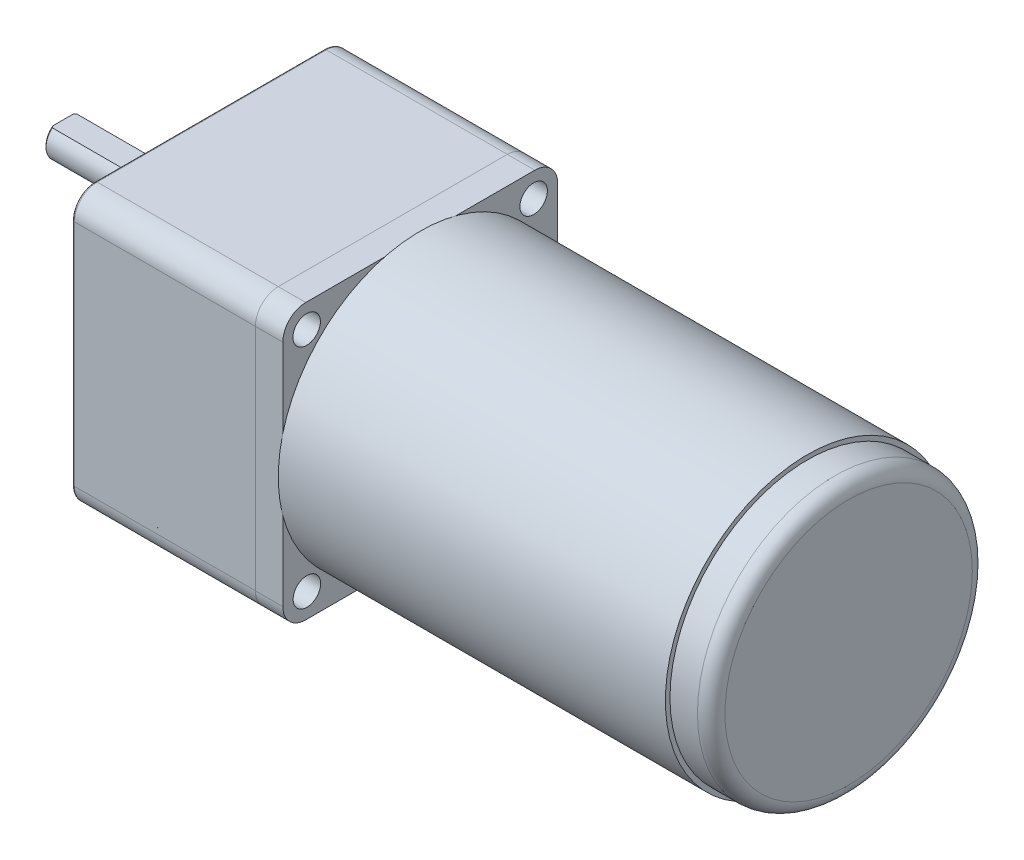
ISO-10303-21;
HEADER;
FILE_DESCRIPTION(('STEP AP214'),'2;1');
FILE_NAME('part.step','',(''),(''),'','','');
FILE_SCHEMA(('AUTOMOTIVE_DESIGN { 1 0 10303 214 1 1 1 1 }'));
ENDSEC;
DATA;
#1=APPLICATION_CONTEXT('core data for automotive mechanical design processes');
#2=APPLICATION_PROTOCOL_DEFINITION('international standard','automotive_design',2000,#1);
#3=PRODUCT_CONTEXT('',#1,'mechanical');
#4=PRODUCT('Part','Part','',(#3));
#5=PRODUCT_RELATED_PRODUCT_CATEGORY('part','',(#4));
#6=PRODUCT_DEFINITION_FORMATION('','',#4);
#7=PRODUCT_DEFINITION_CONTEXT('part definition',#1,'design');
#8=PRODUCT_DEFINITION('design','',#6,#7);
#9=PRODUCT_DEFINITION_SHAPE('','',#8);
#10=(LENGTH_UNIT() NAMED_UNIT(*) SI_UNIT(.MILLI.,.METRE.));
#11=(NAMED_UNIT(*) PLANE_ANGLE_UNIT() SI_UNIT($,.RADIAN.));
#12=(NAMED_UNIT(*) SI_UNIT($,.STERADIAN.) SOLID_ANGLE_UNIT());
#13=UNCERTAINTY_MEASURE_WITH_UNIT(LENGTH_MEASURE(1.E-05),#10,'distance_accuracy_value','');
#14=(GEOMETRIC_REPRESENTATION_CONTEXT(3) GLOBAL_UNCERTAINTY_ASSIGNED_CONTEXT((#13)) GLOBAL_UNIT_ASSIGNED_CONTEXT((#10,
#11,#12)) REPRESENTATION_CONTEXT('',''));
#15=CARTESIAN_POINT('',(0.,0.,0.));
#16=DIRECTION('',(0.,0.,1.));
#17=DIRECTION('',(1.,0.,0.));
#18=AXIS2_PLACEMENT_3D('',#15,#16,#17);
#19=CARTESIAN_POINT('',(139.5,0.,0.));
#20=DIRECTION('',(-1.,0.,0.));
#21=DIRECTION('',(0.,0.,1.));
#22=AXIS2_PLACEMENT_3D('',#19,#20,#21);
#23=CYLINDRICAL_SURFACE('',#22,30.);
#24=CARTESIAN_POINT('',(136.5,0.,0.));
#25=DIRECTION('',(1.,0.,0.));
#26=DIRECTION('',(0.,0.,-1.));
#27=AXIS2_PLACEMENT_3D('',#24,#25,#26);
#28=CIRCLE('',#27,30.);
#29=CARTESIAN_POINT('',(136.5,0.,-30.));
#30=VERTEX_POINT('',#29);
#31=EDGE_CURVE('E11',#30,#30,#28,.F.);
#32=ORIENTED_EDGE('',*,*,#31,.T.);
#33=EDGE_LOOP('',(#32));
#34=FACE_BOUND('',#33,.T.);
#35=CARTESIAN_POINT('',(130.5,0.,0.));
#36=DIRECTION('',(1.,0.,0.));
#37=DIRECTION('',(0.,0.,-1.));
#38=AXIS2_PLACEMENT_3D('',#35,#36,#37);
#39=CIRCLE('',#38,30.);
#40=CARTESIAN_POINT('',(130.5,0.,-30.));
#41=VERTEX_POINT('',#40);
#42=EDGE_CURVE('E57',#41,#41,#39,.T.);
#43=ORIENTED_EDGE('',*,*,#42,.T.);
#44=EDGE_LOOP('',(#43));
#45=FACE_BOUND('',#44,.T.);
#46=ADVANCED_FACE('F46',(#34,#45),#23,.T.);
#47=CARTESIAN_POINT('',(139.5,0.,0.));
#48=DIRECTION('',(1.,0.,0.));
#49=DIRECTION('',(0.,0.,-1.));
#50=AXIS2_PLACEMENT_3D('',#47,#48,#49);
#51=PLANE('',#50);
#52=CARTESIAN_POINT('',(139.5,0.,0.));
#53=DIRECTION('',(1.,0.,0.));
#54=DIRECTION('',(0.,0.,-1.));
#55=AXIS2_PLACEMENT_3D('',#52,#53,#54);
#56=CIRCLE('',#55,27.);
#57=CARTESIAN_POINT('',(139.5,0.,-27.));
#58=VERTEX_POINT('',#57);
#59=EDGE_CURVE('E53',#58,#58,#56,.T.);
#60=ORIENTED_EDGE('',*,*,#59,.T.);
#61=EDGE_LOOP('',(#60));
#62=FACE_BOUND('',#61,.T.);
#63=ADVANCED_FACE('F67',(#62),#51,.T.);
#64=CARTESIAN_POINT('',(130.5,0.,0.));
#65=DIRECTION('',(1.,0.,0.));
#66=DIRECTION('',(0.,0.,-1.));
#67=AXIS2_PLACEMENT_3D('',#64,#65,#66);
#68=PLANE('',#67);
#69=ORIENTED_EDGE('',*,*,#42,.F.);
#70=EDGE_LOOP('',(#69));
#71=FACE_BOUND('',#70,.T.);
#72=ADVANCED_FACE('F65',(#71),#68,.F.);
#73=CARTESIAN_POINT('',(136.5,0.,0.));
#74=DIRECTION('',(1.,0.,0.));
#75=DIRECTION('',(0.,0.,-1.));
#76=AXIS2_PLACEMENT_3D('',#73,#74,#75);
#77=TOROIDAL_SURFACE('',#76,27.,3.);
#78=ORIENTED_EDGE('',*,*,#31,.F.);
#79=EDGE_LOOP('',(#78));
#80=FACE_BOUND('',#79,.T.);
#81=ORIENTED_EDGE('',*,*,#59,.F.);
#82=EDGE_LOOP('',(#81));
#83=FACE_BOUND('',#82,.T.);
#84=ADVANCED_FACE('F48',(#80,#83),#77,.T.);
#85=CLOSED_SHELL('',(#46,#63,#72,#84));
#86=MANIFOLD_SOLID_BREP('B2',#85);
#87=CARTESIAN_POINT('',(130.5,0.,0.));
#88=DIRECTION('',(-1.,0.,0.));
#89=DIRECTION('',(0.,0.,1.));
#90=AXIS2_PLACEMENT_3D('',#87,#88,#89);
#91=CYLINDRICAL_SURFACE('',#90,31.);
#92=CARTESIAN_POINT('',(130.5,0.,0.));
#93=DIRECTION('',(1.,0.,0.));
#94=DIRECTION('',(0.,0.,-1.));
#95=AXIS2_PLACEMENT_3D('',#92,#93,#94);
#96=CIRCLE('',#95,31.);
#97=CARTESIAN_POINT('',(130.5,0.,-31.));
#98=VERTEX_POINT('',#97);
#99=EDGE_CURVE('E45',#98,#98,#96,.T.);
#100=ORIENTED_EDGE('',*,*,#99,.F.);
#101=EDGE_LOOP('',(#100));
#102=FACE_BOUND('',#101,.T.);
#103=CARTESIAN_POINT('',(46.,0.,0.));
#104=DIRECTION('',(1.,0.,0.));
#105=DIRECTION('',(0.,0.,-1.));
#106=AXIS2_PLACEMENT_3D('',#103,#104,#105);
#107=CIRCLE('',#106,31.);
#108=CARTESIAN_POINT('',(46.,0.,-31.));
#109=VERTEX_POINT('',#108);
#110=EDGE_CURVE('E115',#109,#109,#107,.T.);
#111=ORIENTED_EDGE('',*,*,#110,.T.);
#112=EDGE_LOOP('',(#111));
#113=FACE_BOUND('',#112,.T.);
#114=ADVANCED_FACE('F112',(#102,#113),#91,.T.);
#115=CARTESIAN_POINT('',(130.5,0.,0.));
#116=DIRECTION('',(1.,0.,0.));
#117=DIRECTION('',(0.,0.,-1.));
#118=AXIS2_PLACEMENT_3D('',#115,#116,#117);
#119=PLANE('',#118);
#120=ORIENTED_EDGE('',*,*,#99,.T.);
#121=EDGE_LOOP('',(#120));
#122=FACE_BOUND('',#121,.T.);
#123=ADVANCED_FACE('F127',(#122),#119,.T.);
#124=CARTESIAN_POINT('',(46.,0.,0.));
#125=DIRECTION('',(1.,0.,0.));
#126=DIRECTION('',(0.,0.,-1.));
#127=AXIS2_PLACEMENT_3D('',#124,#125,#126);
#128=PLANE('',#127);
#129=ORIENTED_EDGE('',*,*,#110,.F.);
#130=EDGE_LOOP('',(#129));
#131=FACE_BOUND('',#130,.T.);
#132=ADVANCED_FACE('F125',(#131),#128,.F.);
#133=CLOSED_SHELL('',(#114,#123,#132));
#134=MANIFOLD_SOLID_BREP('B6',#133);
#135=CARTESIAN_POINT('',(-32.,10.,0.));
#136=DIRECTION('',(1.,0.,0.));
#137=DIRECTION('',(0.,0.,-1.));
#138=AXIS2_PLACEMENT_3D('',#135,#136,#137);
#139=CYLINDRICAL_SURFACE('',#138,4.);
#140=DIRECTION('',(-1.,0.,0.));
#141=VECTOR('',#140,1.);
#142=CARTESIAN_POINT('',(-7.,13.,2.64575131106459));
#143=LINE('',#142,#141);
#144=CARTESIAN_POINT('',(-7.,13.,2.64575131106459));
#145=VERTEX_POINT('',#144);
#146=CARTESIAN_POINT('',(-31.7,13.,2.64575131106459));
#147=VERTEX_POINT('',#146);
#148=EDGE_CURVE('E204',#145,#147,#143,.T.);
#149=ORIENTED_EDGE('',*,*,#148,.T.);
#150=CARTESIAN_POINT('',(-31.7,10.,0.));
#151=DIRECTION('',(-1.,0.,0.));
#152=DIRECTION('',(0.,0.,1.));
#153=AXIS2_PLACEMENT_3D('',#150,#151,#152);
#154=CIRCLE('',#153,4.);
#155=CARTESIAN_POINT('',(-31.7,13.,-2.64575131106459));
#156=VERTEX_POINT('',#155);
#157=EDGE_CURVE('E110',#147,#156,#154,.F.);
#158=ORIENTED_EDGE('',*,*,#157,.T.);
#159=DIRECTION('',(-1.,0.,0.));
#160=VECTOR('',#159,1.);
#161=CARTESIAN_POINT('',(-7.,13.,-2.64575131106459));
#162=LINE('',#161,#160);
#163=CARTESIAN_POINT('',(-7.,13.,-2.64575131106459));
#164=VERTEX_POINT('',#163);
#165=EDGE_CURVE('E202',#164,#156,#162,.T.);
#166=ORIENTED_EDGE('',*,*,#165,.F.);
#167=CARTESIAN_POINT('',(-7.,10.,0.));
#168=DIRECTION('',(-1.,0.,0.));
#169=DIRECTION('',(0.,0.,1.));
#170=AXIS2_PLACEMENT_3D('',#167,#168,#169);
#171=CIRCLE('',#170,4.);
#172=EDGE_CURVE('E195',#145,#164,#171,.T.);
#173=ORIENTED_EDGE('',*,*,#172,.F.);
#174=EDGE_LOOP('',(#149,#158,#166,#173));
#175=FACE_BOUND('',#174,.T.);
#176=CARTESIAN_POINT('',(-3.,10.,0.));
#177=DIRECTION('',(-1.,0.,0.));
#178=DIRECTION('',(0.,0.,1.));
#179=AXIS2_PLACEMENT_3D('',#176,#177,#178);
#180=CIRCLE('',#179,4.);
#181=CARTESIAN_POINT('',(-3.,10.,4.));
#182=VERTEX_POINT('',#181);
#183=EDGE_CURVE('E208',#182,#182,#180,.T.);
#184=ORIENTED_EDGE('',*,*,#183,.T.);
#185=EDGE_LOOP('',(#184));
#186=FACE_BOUND('',#185,.T.);
#187=ADVANCED_FACE('F161',(#175,#186),#139,.T.);
#188=CARTESIAN_POINT('',(-32.,10.,0.));
#189=DIRECTION('',(-1.,0.,0.));
#190=DIRECTION('',(0.,0.,1.));
#191=AXIS2_PLACEMENT_3D('',#188,#189,#190);
#192=PLANE('',#191);
#193=DIRECTION('',(0.,0.,1.));
#194=VECTOR('',#193,1.);
#195=CARTESIAN_POINT('',(-32.,13.,2.64575131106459));
#196=LINE('',#195,#194);
#197=CARTESIAN_POINT('',(-32.,13.,-2.16564078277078));
#198=VERTEX_POINT('',#197);
#199=CARTESIAN_POINT('',(-32.,13.,2.16564078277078));
#200=VERTEX_POINT('',#199);
#201=EDGE_CURVE('E199',#198,#200,#196,.T.);
#202=ORIENTED_EDGE('',*,*,#201,.F.);
#203=CARTESIAN_POINT('',(-32.,10.,0.));
#204=DIRECTION('',(-1.,0.,0.));
#205=DIRECTION('',(0.,0.,1.));
#206=AXIS2_PLACEMENT_3D('',#203,#204,#205);
#207=CIRCLE('',#206,3.70000000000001);
#208=EDGE_CURVE('E214',#198,#200,#207,.T.);
#209=ORIENTED_EDGE('',*,*,#208,.T.);
#210=EDGE_LOOP('',(#202,#209));
#211=FACE_BOUND('',#210,.T.);
#212=ADVANCED_FACE('F230',(#211),#192,.T.);
#213=CARTESIAN_POINT('',(-3.,10.,0.));
#214=DIRECTION('',(-1.,0.,0.));
#215=DIRECTION('',(0.,0.,1.));
#216=AXIS2_PLACEMENT_3D('',#213,#214,#215);
#217=PLANE('',#216);
#218=ORIENTED_EDGE('',*,*,#183,.F.);
#219=EDGE_LOOP('',(#218));
#220=FACE_BOUND('',#219,.T.);
#221=ADVANCED_FACE('F229',(#220),#217,.F.);
#222=CARTESIAN_POINT('',(-7.,13.,2.64575131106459));
#223=DIRECTION('',(0.,-1.,0.));
#224=DIRECTION('',(0.,0.,-1.));
#225=AXIS2_PLACEMENT_3D('',#222,#223,#224);
#226=PLANE('',#225);
#227=ORIENTED_EDGE('',*,*,#201,.T.);
#228=CARTESIAN_POINT('',(-32.,13.,2.16564078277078));
#229=CARTESIAN_POINT('',(-31.9761619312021,13.,2.20636622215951));
#230=CARTESIAN_POINT('',(-31.95199678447,13.,2.2468991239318));
#231=CARTESIAN_POINT('',(-31.9030718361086,13.,2.32759423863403));
#232=CARTESIAN_POINT('',(-31.8783121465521,13.,2.36775651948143));
#233=CARTESIAN_POINT('',(-31.8282492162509,13.,2.44773910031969));
#234=CARTESIAN_POINT('',(-31.80294598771,13.,2.48755940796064));
#235=CARTESIAN_POINT('',(-31.7518371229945,13.,2.56688695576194));
#236=CARTESIAN_POINT('',(-31.7260313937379,13.,2.60639413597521));
#237=CARTESIAN_POINT('',(-31.7000000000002,13.,2.64575131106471));
#238=B_SPLINE_CURVE_WITH_KNOTS('',3,(#228,#229,#230,#231,#232,#233,#234,#235,#236,#237),
.UNSPECIFIED.,.F.,.F.,(4,2,2,2,4),(0.,0.141564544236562,0.28310260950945,0.424637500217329,
0.566198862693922),.UNSPECIFIED.);
#239=EDGE_CURVE('E170',#200,#147,#238,.T.);
#240=ORIENTED_EDGE('',*,*,#239,.T.);
#241=ORIENTED_EDGE('',*,*,#148,.F.);
#242=DIRECTION('',(0.,0.,1.));
#243=VECTOR('',#242,1.);
#244=CARTESIAN_POINT('',(-7.,13.,2.64575131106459));
#245=LINE('',#244,#243);
#246=EDGE_CURVE('E198',#164,#145,#245,.T.);
#247=ORIENTED_EDGE('',*,*,#246,.F.);
#248=ORIENTED_EDGE('',*,*,#165,.T.);
#249=CARTESIAN_POINT('',(-31.7,13.,-2.64575131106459));
#250=CARTESIAN_POINT('',(-31.7260313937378,13.,-2.60639413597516));
#251=CARTESIAN_POINT('',(-31.7518371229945,13.,-2.56688695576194));
#252=CARTESIAN_POINT('',(-31.80294598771,13.,-2.48755940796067));
#253=CARTESIAN_POINT('',(-31.8282492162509,13.,-2.44773910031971));
#254=CARTESIAN_POINT('',(-31.878312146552,13.,-2.36775651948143));
#255=CARTESIAN_POINT('',(-31.9030718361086,13.,-2.32759423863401));
#256=CARTESIAN_POINT('',(-31.9519967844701,13.,-2.24689912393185));
#257=CARTESIAN_POINT('',(-31.9761619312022,13.,-2.20636622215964));
#258=CARTESIAN_POINT('',(-32.0000000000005,13.,-2.16564078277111));
#259=B_SPLINE_CURVE_WITH_KNOTS('',3,(#249,#250,#251,#252,#253,#254,#255,#256,#257,#258),
.UNSPECIFIED.,.F.,.F.,(4,2,2,2,4),(0.,0.141561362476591,0.283096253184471,0.424634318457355,
0.566198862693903),.UNSPECIFIED.);
#260=EDGE_CURVE('E217',#156,#198,#259,.T.);
#261=ORIENTED_EDGE('',*,*,#260,.T.);
#262=EDGE_LOOP('',(#227,#240,#241,#247,#248,#261));
#263=FACE_BOUND('',#262,.T.);
#264=ADVANCED_FACE('F201',(#263),#226,.F.);
#265=CARTESIAN_POINT('',(-7.,10.,0.));
#266=DIRECTION('',(-1.,0.,0.));
#267=DIRECTION('',(0.,0.,1.));
#268=AXIS2_PLACEMENT_3D('',#265,#266,#267);
#269=PLANE('',#268);
#270=ORIENTED_EDGE('',*,*,#172,.T.);
#271=ORIENTED_EDGE('',*,*,#246,.T.);
#272=EDGE_LOOP('',(#270,#271));
#273=FACE_BOUND('',#272,.T.);
#274=ADVANCED_FACE('F197',(#273),#269,.T.);
#275=CARTESIAN_POINT('',(-32.,10.,0.));
#276=DIRECTION('',(1.,0.,0.));
#277=DIRECTION('',(0.,0.,-1.));
#278=AXIS2_PLACEMENT_3D('',#275,#276,#277);
#279=CONICAL_SURFACE('',#278,3.70000000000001,0.785398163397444);
#280=ORIENTED_EDGE('',*,*,#260,.F.);
#281=ORIENTED_EDGE('',*,*,#157,.F.);
#282=ORIENTED_EDGE('',*,*,#239,.F.);
#283=ORIENTED_EDGE('',*,*,#208,.F.);
#284=EDGE_LOOP('',(#280,#281,#282,#283));
#285=FACE_BOUND('',#284,.T.);
#286=ADVANCED_FACE('F163',(#285),#279,.T.);
#287=CLOSED_SHELL('',(#187,#212,#221,#264,#274,#286));
#288=MANIFOLD_SOLID_BREP('B40',#287);
#289=CARTESIAN_POINT('',(-3.,10.,0.));
#290=DIRECTION('',(1.,0.,0.));
#291=DIRECTION('',(0.,0.,-1.));
#292=AXIS2_PLACEMENT_3D('',#289,#290,#291);
#293=CYLINDRICAL_SURFACE('',#292,12.);
#294=CARTESIAN_POINT('',(-2.5,10.,0.));
#295=DIRECTION('',(-1.,0.,0.));
#296=DIRECTION('',(0.,0.,1.));
#297=AXIS2_PLACEMENT_3D('',#294,#295,#296);
#298=CIRCLE('',#297,12.);
#299=CARTESIAN_POINT('',(-2.5,10.,12.));
#300=VERTEX_POINT('',#299);
#301=EDGE_CURVE('E160',#300,#300,#298,.F.);
#302=ORIENTED_EDGE('',*,*,#301,.T.);
#303=EDGE_LOOP('',(#302));
#304=FACE_BOUND('',#303,.T.);
#305=CARTESIAN_POINT('',(0.,10.,0.));
#306=DIRECTION('',(-1.,0.,0.));
#307=DIRECTION('',(0.,0.,1.));
#308=AXIS2_PLACEMENT_3D('',#305,#306,#307);
#309=CIRCLE('',#308,12.);
#310=CARTESIAN_POINT('',(0.,10.,12.));
#311=VERTEX_POINT('',#310);
#312=EDGE_CURVE('E305',#311,#311,#309,.T.);
#313=ORIENTED_EDGE('',*,*,#312,.T.);
#314=EDGE_LOOP('',(#313));
#315=FACE_BOUND('',#314,.T.);
#316=ADVANCED_FACE('F294',(#304,#315),#293,.T.);
#317=CARTESIAN_POINT('',(-3.,10.,0.));
#318=DIRECTION('',(-1.,0.,0.));
#319=DIRECTION('',(0.,0.,1.));
#320=AXIS2_PLACEMENT_3D('',#317,#318,#319);
#321=PLANE('',#320);
#322=CARTESIAN_POINT('',(-3.,10.,0.));
#323=DIRECTION('',(-1.,0.,0.));
#324=DIRECTION('',(0.,0.,1.));
#325=AXIS2_PLACEMENT_3D('',#322,#323,#324);
#326=CIRCLE('',#325,11.5);
#327=CARTESIAN_POINT('',(-3.,10.,11.5));
#328=VERTEX_POINT('',#327);
#329=EDGE_CURVE('E301',#328,#328,#326,.T.);
#330=ORIENTED_EDGE('',*,*,#329,.T.);
#331=EDGE_LOOP('',(#330));
#332=FACE_BOUND('',#331,.T.);
#333=ADVANCED_FACE('F315',(#332),#321,.T.);
#334=CARTESIAN_POINT('',(0.,10.,0.));
#335=DIRECTION('',(-1.,0.,0.));
#336=DIRECTION('',(0.,0.,1.));
#337=AXIS2_PLACEMENT_3D('',#334,#335,#336);
#338=PLANE('',#337);
#339=ORIENTED_EDGE('',*,*,#312,.F.);
#340=EDGE_LOOP('',(#339));
#341=FACE_BOUND('',#340,.T.);
#342=ADVANCED_FACE('F313',(#341),#338,.F.);
#343=CARTESIAN_POINT('',(-2.5,10.,0.));
#344=DIRECTION('',(-1.,0.,0.));
#345=DIRECTION('',(0.,0.,1.));
#346=AXIS2_PLACEMENT_3D('',#343,#344,#345);
#347=TOROIDAL_SURFACE('',#346,11.5,0.5);
#348=ORIENTED_EDGE('',*,*,#301,.F.);
#349=EDGE_LOOP('',(#348));
#350=FACE_BOUND('',#349,.T.);
#351=ORIENTED_EDGE('',*,*,#329,.F.);
#352=EDGE_LOOP('',(#351));
#353=FACE_BOUND('',#352,.T.);
#354=ADVANCED_FACE('F296',(#350,#353),#347,.T.);
#355=CLOSED_SHELL('',(#316,#333,#342,#354));
#356=MANIFOLD_SOLID_BREP('B104',#355);
#357=CARTESIAN_POINT('',(46.,25.,-25.));
#358=DIRECTION('',(-1.,0.,0.));
#359=DIRECTION('',(0.,0.,1.));
#360=AXIS2_PLACEMENT_3D('',#357,#358,#359);
#361=CYLINDRICAL_SURFACE('',#360,5.);
#362=CARTESIAN_POINT('',(40.,25.,-25.));
#363=DIRECTION('',(1.,0.,0.));
#364=DIRECTION('',(0.,0.,1.));
#365=AXIS2_PLACEMENT_3D('',#362,#363,#364);
#366=CIRCLE('',#365,5.);
#367=CARTESIAN_POINT('',(40.,25.,-30.));
#368=VERTEX_POINT('',#367);
#369=CARTESIAN_POINT('',(40.,30.,-25.));
#370=VERTEX_POINT('',#369);
#371=EDGE_CURVE('E457',#368,#370,#366,.T.);
#372=ORIENTED_EDGE('',*,*,#371,.T.);
#373=DIRECTION('',(-1.,0.,0.));
#374=VECTOR('',#373,1.);
#375=CARTESIAN_POINT('',(46.,30.,-25.));
#376=LINE('',#375,#374);
#377=CARTESIAN_POINT('',(46.,30.,-25.));
#378=VERTEX_POINT('',#377);
#379=EDGE_CURVE('E292',#378,#370,#376,.T.);
#380=ORIENTED_EDGE('',*,*,#379,.F.);
#381=CARTESIAN_POINT('',(46.,25.,-25.));
#382=DIRECTION('',(1.,0.,0.));
#383=DIRECTION('',(0.,0.,1.));
#384=AXIS2_PLACEMENT_3D('',#381,#382,#383);
#385=CIRCLE('',#384,5.);
#386=CARTESIAN_POINT('',(46.,25.,-30.));
#387=VERTEX_POINT('',#386);
#388=EDGE_CURVE('E471',#387,#378,#385,.T.);
#389=ORIENTED_EDGE('',*,*,#388,.F.);
#390=DIRECTION('',(-1.,0.,0.));
#391=VECTOR('',#390,1.);
#392=CARTESIAN_POINT('',(46.,25.,-30.));
#393=LINE('',#392,#391);
#394=EDGE_CURVE('E453',#387,#368,#393,.T.);
#395=ORIENTED_EDGE('',*,*,#394,.T.);
#396=EDGE_LOOP('',(#372,#380,#389,#395));
#397=FACE_BOUND('',#396,.T.);
#398=ADVANCED_FACE('F359',(#397),#361,.T.);
#399=CARTESIAN_POINT('',(46.,30.,25.));
#400=DIRECTION('',(0.,-1.,0.));
#401=DIRECTION('',(0.,0.,-1.));
#402=AXIS2_PLACEMENT_3D('',#399,#400,#401);
#403=PLANE('',#402);
#404=DIRECTION('',(0.,0.,1.));
#405=VECTOR('',#404,1.);
#406=CARTESIAN_POINT('',(40.,30.,25.));
#407=LINE('',#406,#405);
#408=CARTESIAN_POINT('',(40.,30.,25.));
#409=VERTEX_POINT('',#408);
#410=EDGE_CURVE('E460',#370,#409,#407,.T.);
#411=ORIENTED_EDGE('',*,*,#410,.T.);
#412=DIRECTION('',(-1.,0.,0.));
#413=VECTOR('',#412,1.);
#414=CARTESIAN_POINT('',(46.,30.,25.));
#415=LINE('',#414,#413);
#416=CARTESIAN_POINT('',(46.,30.,25.));
#417=VERTEX_POINT('',#416);
#418=EDGE_CURVE('E368',#417,#409,#415,.T.);
#419=ORIENTED_EDGE('',*,*,#418,.F.);
#420=DIRECTION('',(0.,0.,1.));
#421=VECTOR('',#420,1.);
#422=CARTESIAN_POINT('',(46.,30.,25.));
#423=LINE('',#422,#421);
#424=EDGE_CURVE('E420',#378,#417,#423,.T.);
#425=ORIENTED_EDGE('',*,*,#424,.F.);
#426=ORIENTED_EDGE('',*,*,#379,.T.);
#427=EDGE_LOOP('',(#411,#419,#425,#426));
#428=FACE_BOUND('',#427,.T.);
#429=ADVANCED_FACE('F525',(#428),#403,.F.);
#430=CARTESIAN_POINT('',(46.,25.,25.));
#431=DIRECTION('',(-1.,0.,0.));
#432=DIRECTION('',(0.,0.,1.));
#433=AXIS2_PLACEMENT_3D('',#430,#431,#432);
#434=CYLINDRICAL_SURFACE('',#433,5.);
#435=CARTESIAN_POINT('',(40.,25.,25.));
#436=DIRECTION('',(1.,0.,0.));
#437=DIRECTION('',(0.,0.,1.));
#438=AXIS2_PLACEMENT_3D('',#435,#436,#437);
#439=CIRCLE('',#438,5.);
#440=CARTESIAN_POINT('',(40.,25.,30.));
#441=VERTEX_POINT('',#440);
#442=EDGE_CURVE('E462',#409,#441,#439,.T.);
#443=ORIENTED_EDGE('',*,*,#442,.T.);
#444=DIRECTION('',(-1.,0.,0.));
#445=VECTOR('',#444,1.);
#446=CARTESIAN_POINT('',(46.,25.,30.));
#447=LINE('',#446,#445);
#448=CARTESIAN_POINT('',(46.,25.,30.));
#449=VERTEX_POINT('',#448);
#450=EDGE_CURVE('E478',#449,#441,#447,.T.);
#451=ORIENTED_EDGE('',*,*,#450,.F.);
#452=CARTESIAN_POINT('',(46.,25.,25.));
#453=DIRECTION('',(1.,0.,0.));
#454=DIRECTION('',(0.,0.,1.));
#455=AXIS2_PLACEMENT_3D('',#452,#453,#454);
#456=CIRCLE('',#455,5.);
#457=EDGE_CURVE('E626',#417,#449,#456,.T.);
#458=ORIENTED_EDGE('',*,*,#457,.F.);
#459=ORIENTED_EDGE('',*,*,#418,.T.);
#460=EDGE_LOOP('',(#443,#451,#458,#459));
#461=FACE_BOUND('',#460,.T.);
#462=ADVANCED_FACE('F529',(#461),#434,.T.);
#463=CARTESIAN_POINT('',(46.,-25.,30.));
#464=DIRECTION('',(0.,0.,-1.));
#465=DIRECTION('',(-1.,0.,0.));
#466=AXIS2_PLACEMENT_3D('',#463,#464,#465);
#467=PLANE('',#466);
#468=DIRECTION('',(0.,-1.,0.));
#469=VECTOR('',#468,1.);
#470=CARTESIAN_POINT('',(40.,-25.,30.));
#471=LINE('',#470,#469);
#472=CARTESIAN_POINT('',(40.,-25.,30.));
#473=VERTEX_POINT('',#472);
#474=EDGE_CURVE('E464',#441,#473,#471,.T.);
#475=ORIENTED_EDGE('',*,*,#474,.T.);
#476=DIRECTION('',(-1.,0.,0.));
#477=VECTOR('',#476,1.);
#478=CARTESIAN_POINT('',(46.,-25.,30.));
#479=LINE('',#478,#477);
#480=CARTESIAN_POINT('',(46.,-25.,30.));
#481=VERTEX_POINT('',#480);
#482=EDGE_CURVE('E475',#481,#473,#479,.T.);
#483=ORIENTED_EDGE('',*,*,#482,.F.);
#484=DIRECTION('',(0.,-1.,0.));
#485=VECTOR('',#484,1.);
#486=CARTESIAN_POINT('',(46.,-25.,30.));
#487=LINE('',#486,#485);
#488=EDGE_CURVE('E628',#449,#481,#487,.T.);
#489=ORIENTED_EDGE('',*,*,#488,.F.);
#490=ORIENTED_EDGE('',*,*,#450,.T.);
#491=EDGE_LOOP('',(#475,#483,#489,#490));
#492=FACE_BOUND('',#491,.T.);
#493=ADVANCED_FACE('F533',(#492),#467,.F.);
#494=CARTESIAN_POINT('',(46.,-25.,25.));
#495=DIRECTION('',(-1.,0.,0.));
#496=DIRECTION('',(0.,0.,1.));
#497=AXIS2_PLACEMENT_3D('',#494,#495,#496);
#498=CYLINDRICAL_SURFACE('',#497,5.);
#499=CARTESIAN_POINT('',(40.,-25.,25.));
#500=DIRECTION('',(1.,0.,0.));
#501=DIRECTION('',(0.,0.,1.));
#502=AXIS2_PLACEMENT_3D('',#499,#500,#501);
#503=CIRCLE('',#502,5.);
#504=CARTESIAN_POINT('',(40.,-30.,25.));
#505=VERTEX_POINT('',#504);
#506=EDGE_CURVE('E466',#473,#505,#503,.T.);
#507=ORIENTED_EDGE('',*,*,#506,.T.);
#508=DIRECTION('',(-1.,0.,0.));
#509=VECTOR('',#508,1.);
#510=CARTESIAN_POINT('',(46.,-30.,25.));
#511=LINE('',#510,#509);
#512=CARTESIAN_POINT('',(46.,-30.,25.));
#513=VERTEX_POINT('',#512);
#514=EDGE_CURVE('E448',#513,#505,#511,.T.);
#515=ORIENTED_EDGE('',*,*,#514,.F.);
#516=CARTESIAN_POINT('',(46.,-25.,25.));
#517=DIRECTION('',(1.,0.,0.));
#518=DIRECTION('',(0.,0.,1.));
#519=AXIS2_PLACEMENT_3D('',#516,#517,#518);
#520=CIRCLE('',#519,5.);
#521=EDGE_CURVE('E439',#481,#513,#520,.T.);
#522=ORIENTED_EDGE('',*,*,#521,.F.);
#523=ORIENTED_EDGE('',*,*,#482,.T.);
#524=EDGE_LOOP('',(#507,#515,#522,#523));
#525=FACE_BOUND('',#524,.T.);
#526=ADVANCED_FACE('F539',(#525),#498,.T.);
#527=CARTESIAN_POINT('',(46.,-30.,25.));
#528=DIRECTION('',(0.,1.,0.));
#529=DIRECTION('',(0.,0.,1.));
#530=AXIS2_PLACEMENT_3D('',#527,#528,#529);
#531=PLANE('',#530);
#532=DIRECTION('',(0.,0.,-1.));
#533=VECTOR('',#532,1.);
#534=CARTESIAN_POINT('',(40.,-30.,25.));
#535=LINE('',#534,#533);
#536=CARTESIAN_POINT('',(40.,-30.,-25.));
#537=VERTEX_POINT('',#536);
#538=EDGE_CURVE('E447',#505,#537,#535,.T.);
#539=ORIENTED_EDGE('',*,*,#538,.T.);
#540=DIRECTION('',(-1.,0.,0.));
#541=VECTOR('',#540,1.);
#542=CARTESIAN_POINT('',(46.,-30.,-25.));
#543=LINE('',#542,#541);
#544=CARTESIAN_POINT('',(46.,-30.,-25.));
#545=VERTEX_POINT('',#544);
#546=EDGE_CURVE('E444',#545,#537,#543,.T.);
#547=ORIENTED_EDGE('',*,*,#546,.F.);
#548=DIRECTION('',(0.,0.,-1.));
#549=VECTOR('',#548,1.);
#550=CARTESIAN_POINT('',(46.,-30.,25.));
#551=LINE('',#550,#549);
#552=EDGE_CURVE('E433',#513,#545,#551,.T.);
#553=ORIENTED_EDGE('',*,*,#552,.F.);
#554=ORIENTED_EDGE('',*,*,#514,.T.);
#555=EDGE_LOOP('',(#539,#547,#553,#554));
#556=FACE_BOUND('',#555,.T.);
#557=ADVANCED_FACE('F445',(#556),#531,.F.);
#558=CARTESIAN_POINT('',(46.,-25.,-25.));
#559=DIRECTION('',(-1.,0.,0.));
#560=DIRECTION('',(0.,0.,1.));
#561=AXIS2_PLACEMENT_3D('',#558,#559,#560);
#562=CYLINDRICAL_SURFACE('',#561,5.);
#563=CARTESIAN_POINT('',(40.,-25.,-25.));
#564=DIRECTION('',(1.,0.,0.));
#565=DIRECTION('',(0.,0.,-1.));
#566=AXIS2_PLACEMENT_3D('',#563,#564,#565);
#567=CIRCLE('',#566,5.);
#568=CARTESIAN_POINT('',(40.,-25.,-30.));
#569=VERTEX_POINT('',#568);
#570=EDGE_CURVE('E406',#537,#569,#567,.T.);
#571=ORIENTED_EDGE('',*,*,#570,.T.);
#572=DIRECTION('',(-1.,0.,0.));
#573=VECTOR('',#572,1.);
#574=CARTESIAN_POINT('',(46.,-25.,-30.));
#575=LINE('',#574,#573);
#576=CARTESIAN_POINT('',(46.,-25.,-30.));
#577=VERTEX_POINT('',#576);
#578=EDGE_CURVE('E449',#577,#569,#575,.T.);
#579=ORIENTED_EDGE('',*,*,#578,.F.);
#580=CARTESIAN_POINT('',(46.,-25.,-25.));
#581=DIRECTION('',(1.,0.,0.));
#582=DIRECTION('',(0.,0.,-1.));
#583=AXIS2_PLACEMENT_3D('',#580,#581,#582);
#584=CIRCLE('',#583,5.);
#585=EDGE_CURVE('E437',#545,#577,#584,.T.);
#586=ORIENTED_EDGE('',*,*,#585,.F.);
#587=ORIENTED_EDGE('',*,*,#546,.T.);
#588=EDGE_LOOP('',(#571,#579,#586,#587));
#589=FACE_BOUND('',#588,.T.);
#590=ADVANCED_FACE('F451',(#589),#562,.T.);
#591=CARTESIAN_POINT('',(46.,-25.,-30.));
#592=DIRECTION('',(0.,0.,1.));
#593=DIRECTION('',(1.,0.,0.));
#594=AXIS2_PLACEMENT_3D('',#591,#592,#593);
#595=PLANE('',#594);
#596=DIRECTION('',(0.,1.,0.));
#597=VECTOR('',#596,1.);
#598=CARTESIAN_POINT('',(40.,-25.,-30.));
#599=LINE('',#598,#597);
#600=EDGE_CURVE('E412',#569,#368,#599,.T.);
#601=ORIENTED_EDGE('',*,*,#600,.T.);
#602=ORIENTED_EDGE('',*,*,#394,.F.);
#603=DIRECTION('',(0.,1.,0.));
#604=VECTOR('',#603,1.);
#605=CARTESIAN_POINT('',(46.,-25.,-30.));
#606=LINE('',#605,#604);
#607=EDGE_CURVE('E377',#577,#387,#606,.T.);
#608=ORIENTED_EDGE('',*,*,#607,.F.);
#609=ORIENTED_EDGE('',*,*,#578,.T.);
#610=EDGE_LOOP('',(#601,#602,#608,#609));
#611=FACE_BOUND('',#610,.T.);
#612=ADVANCED_FACE('F514',(#611),#595,.F.);
#613=CARTESIAN_POINT('',(46.,25.,-25.));
#614=DIRECTION('',(-1.,0.,0.));
#615=DIRECTION('',(0.,0.,1.));
#616=AXIS2_PLACEMENT_3D('',#613,#614,#615);
#617=PLANE('',#616);
#618=CARTESIAN_POINT('',(46.,24.8007290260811,24.8007290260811));
#619=DIRECTION('',(1.,0.,0.));
#620=DIRECTION('',(0.,0.,-1.));
#621=AXIS2_PLACEMENT_3D('',#618,#619,#620);
#622=CIRCLE('',#621,3.);
#623=CARTESIAN_POINT('',(46.,24.8007290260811,21.8007290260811));
#624=VERTEX_POINT('',#623);
#625=EDGE_CURVE('E487',#624,#624,#622,.T.);
#626=ORIENTED_EDGE('',*,*,#625,.F.);
#627=EDGE_LOOP('',(#626));
#628=FACE_BOUND('',#627,.T.);
#629=CARTESIAN_POINT('',(46.,24.7487373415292,-24.7487373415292));
#630=DIRECTION('',(1.,0.,0.));
#631=DIRECTION('',(0.,0.,-1.));
#632=AXIS2_PLACEMENT_3D('',#629,#630,#631);
#633=CIRCLE('',#632,3.);
#634=CARTESIAN_POINT('',(46.,24.7487373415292,-27.7487373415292));
#635=VERTEX_POINT('',#634);
#636=EDGE_CURVE('E612',#635,#635,#633,.T.);
#637=ORIENTED_EDGE('',*,*,#636,.F.);
#638=EDGE_LOOP('',(#637));
#639=FACE_BOUND('',#638,.T.);
#640=CARTESIAN_POINT('',(46.,-24.7487373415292,-24.7487373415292));
#641=DIRECTION('',(1.,0.,0.));
#642=DIRECTION('',(0.,0.,-1.));
#643=AXIS2_PLACEMENT_3D('',#640,#641,#642);
#644=CIRCLE('',#643,3.);
#645=CARTESIAN_POINT('',(46.,-24.7487373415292,-27.7487373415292));
#646=VERTEX_POINT('',#645);
#647=EDGE_CURVE('E614',#646,#646,#644,.T.);
#648=ORIENTED_EDGE('',*,*,#647,.F.);
#649=EDGE_LOOP('',(#648));
#650=FACE_BOUND('',#649,.T.);
#651=CARTESIAN_POINT('',(46.,-24.7487373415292,24.7487373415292));
#652=DIRECTION('',(1.,0.,0.));
#653=DIRECTION('',(0.,0.,-1.));
#654=AXIS2_PLACEMENT_3D('',#651,#652,#653);
#655=CIRCLE('',#654,3.);
#656=CARTESIAN_POINT('',(46.,-24.7487373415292,21.7487373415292));
#657=VERTEX_POINT('',#656);
#658=EDGE_CURVE('E619',#657,#657,#655,.T.);
#659=ORIENTED_EDGE('',*,*,#658,.F.);
#660=EDGE_LOOP('',(#659));
#661=FACE_BOUND('',#660,.T.);
#662=ORIENTED_EDGE('',*,*,#388,.T.);
#663=ORIENTED_EDGE('',*,*,#424,.T.);
#664=ORIENTED_EDGE('',*,*,#457,.T.);
#665=ORIENTED_EDGE('',*,*,#488,.T.);
#666=ORIENTED_EDGE('',*,*,#521,.T.);
#667=ORIENTED_EDGE('',*,*,#552,.T.);
#668=ORIENTED_EDGE('',*,*,#585,.T.);
#669=ORIENTED_EDGE('',*,*,#607,.T.);
#670=EDGE_LOOP('',(#662,#663,#664,#665,#666,#667,#668,#669));
#671=FACE_BOUND('',#670,.T.);
#672=ADVANCED_FACE('F435',(#628,#639,#650,#661,#671),#617,.F.);
#673=CARTESIAN_POINT('',(40.,25.,-25.));
#674=DIRECTION('',(-1.,0.,0.));
#675=DIRECTION('',(0.,0.,1.));
#676=AXIS2_PLACEMENT_3D('',#673,#674,#675);
#677=PLANE('',#676);
#678=CARTESIAN_POINT('',(40.,24.8007290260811,24.8007290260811));
#679=DIRECTION('',(-1.,0.,0.));
#680=DIRECTION('',(0.,0.,1.));
#681=AXIS2_PLACEMENT_3D('',#678,#679,#680);
#682=CIRCLE('',#681,3.);
#683=CARTESIAN_POINT('',(40.,24.8007290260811,27.8007290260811));
#684=VERTEX_POINT('',#683);
#685=EDGE_CURVE('E362',#684,#684,#682,.T.);
#686=ORIENTED_EDGE('',*,*,#685,.F.);
#687=EDGE_LOOP('',(#686));
#688=FACE_BOUND('',#687,.T.);
#689=CARTESIAN_POINT('',(40.,24.7487373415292,-24.7487373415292));
#690=DIRECTION('',(-1.,0.,0.));
#691=DIRECTION('',(0.,0.,1.));
#692=AXIS2_PLACEMENT_3D('',#689,#690,#691);
#693=CIRCLE('',#692,3.);
#694=CARTESIAN_POINT('',(40.,24.7487373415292,-21.7487373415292));
#695=VERTEX_POINT('',#694);
#696=EDGE_CURVE('E489',#695,#695,#693,.T.);
#697=ORIENTED_EDGE('',*,*,#696,.F.);
#698=EDGE_LOOP('',(#697));
#699=FACE_BOUND('',#698,.T.);
#700=CARTESIAN_POINT('',(40.,-24.7487373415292,-24.7487373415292));
#701=DIRECTION('',(-1.,0.,0.));
#702=DIRECTION('',(0.,0.,1.));
#703=AXIS2_PLACEMENT_3D('',#700,#701,#702);
#704=CIRCLE('',#703,3.);
#705=CARTESIAN_POINT('',(40.,-24.7487373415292,-21.7487373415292));
#706=VERTEX_POINT('',#705);
#707=EDGE_CURVE('E486',#706,#706,#704,.T.);
#708=ORIENTED_EDGE('',*,*,#707,.F.);
#709=EDGE_LOOP('',(#708));
#710=FACE_BOUND('',#709,.T.);
#711=CARTESIAN_POINT('',(40.,-24.7487373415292,24.7487373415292));
#712=DIRECTION('',(-1.,0.,0.));
#713=DIRECTION('',(0.,0.,1.));
#714=AXIS2_PLACEMENT_3D('',#711,#712,#713);
#715=CIRCLE('',#714,3.);
#716=CARTESIAN_POINT('',(40.,-24.7487373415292,27.7487373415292));
#717=VERTEX_POINT('',#716);
#718=EDGE_CURVE('E483',#717,#717,#715,.T.);
#719=ORIENTED_EDGE('',*,*,#718,.F.);
#720=EDGE_LOOP('',(#719));
#721=FACE_BOUND('',#720,.T.);
#722=ORIENTED_EDGE('',*,*,#371,.F.);
#723=ORIENTED_EDGE('',*,*,#600,.F.);
#724=ORIENTED_EDGE('',*,*,#570,.F.);
#725=ORIENTED_EDGE('',*,*,#538,.F.);
#726=ORIENTED_EDGE('',*,*,#506,.F.);
#727=ORIENTED_EDGE('',*,*,#474,.F.);
#728=ORIENTED_EDGE('',*,*,#442,.F.);
#729=ORIENTED_EDGE('',*,*,#410,.F.);
#730=EDGE_LOOP('',(#722,#723,#724,#725,#726,#727,#728,#729));
#731=FACE_BOUND('',#730,.T.);
#732=ADVANCED_FACE('F499',(#688,#699,#710,#721,#731),#677,.T.);
#733=CARTESIAN_POINT('',(12.,-24.7487373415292,24.7487373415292));
#734=DIRECTION('',(1.,0.,0.));
#735=DIRECTION('',(0.,0.,-1.));
#736=AXIS2_PLACEMENT_3D('',#733,#734,#735);
#737=CYLINDRICAL_SURFACE('',#736,3.);
#738=ORIENTED_EDGE('',*,*,#718,.T.);
#739=EDGE_LOOP('',(#738));
#740=FACE_BOUND('',#739,.T.);
#741=ORIENTED_EDGE('',*,*,#658,.T.);
#742=EDGE_LOOP('',(#741));
#743=FACE_BOUND('',#742,.T.);
#744=ADVANCED_FACE('F502',(#740,#743),#737,.F.);
#745=CARTESIAN_POINT('',(12.,-24.7487373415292,-24.7487373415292));
#746=DIRECTION('',(1.,0.,0.));
#747=DIRECTION('',(0.,0.,-1.));
#748=AXIS2_PLACEMENT_3D('',#745,#746,#747);
#749=CYLINDRICAL_SURFACE('',#748,3.);
#750=ORIENTED_EDGE('',*,*,#707,.T.);
#751=EDGE_LOOP('',(#750));
#752=FACE_BOUND('',#751,.T.);
#753=ORIENTED_EDGE('',*,*,#647,.T.);
#754=EDGE_LOOP('',(#753));
#755=FACE_BOUND('',#754,.T.);
#756=ADVANCED_FACE('F578',(#752,#755),#749,.F.);
#757=CARTESIAN_POINT('',(12.,24.7487373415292,-24.7487373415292));
#758=DIRECTION('',(1.,0.,0.));
#759=DIRECTION('',(0.,0.,-1.));
#760=AXIS2_PLACEMENT_3D('',#757,#758,#759);
#761=CYLINDRICAL_SURFACE('',#760,3.);
#762=ORIENTED_EDGE('',*,*,#696,.T.);
#763=EDGE_LOOP('',(#762));
#764=FACE_BOUND('',#763,.T.);
#765=ORIENTED_EDGE('',*,*,#636,.T.);
#766=EDGE_LOOP('',(#765));
#767=FACE_BOUND('',#766,.T.);
#768=ADVANCED_FACE('F588',(#764,#767),#761,.F.);
#769=CARTESIAN_POINT('',(12.,24.8007290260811,24.8007290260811));
#770=DIRECTION('',(1.,0.,0.));
#771=DIRECTION('',(0.,0.,-1.));
#772=AXIS2_PLACEMENT_3D('',#769,#770,#771);
#773=CYLINDRICAL_SURFACE('',#772,3.);
#774=ORIENTED_EDGE('',*,*,#685,.T.);
#775=EDGE_LOOP('',(#774));
#776=FACE_BOUND('',#775,.T.);
#777=ORIENTED_EDGE('',*,*,#625,.T.);
#778=EDGE_LOOP('',(#777));
#779=FACE_BOUND('',#778,.T.);
#780=ADVANCED_FACE('F496',(#776,#779),#773,.F.);
#781=CLOSED_SHELL('',(#398,#429,#462,#493,#526,#557,#590,#612,#672,#732,#744,#756,#768,#780));
#782=MANIFOLD_SOLID_BREP('B155',#781);
#783=CARTESIAN_POINT('',(40.,-25.,25.));
#784=DIRECTION('',(-1.,0.,0.));
#785=DIRECTION('',(0.,0.,1.));
#786=AXIS2_PLACEMENT_3D('',#783,#784,#785);
#787=CYLINDRICAL_SURFACE('',#786,5.);
#788=DIRECTION('',(-1.,0.,0.));
#789=VECTOR('',#788,1.);
#790=CARTESIAN_POINT('',(40.,-25.,30.));
#791=LINE('',#790,#789);
#792=CARTESIAN_POINT('',(40.,-25.,30.));
#793=VERTEX_POINT('',#792);
#794=CARTESIAN_POINT('',(0.5,-25.,30.));
#795=VERTEX_POINT('',#794);
#796=EDGE_CURVE('E886',#793,#795,#791,.T.);
#797=ORIENTED_EDGE('',*,*,#796,.T.);
#798=CARTESIAN_POINT('',(0.5,-25.,25.));
#799=DIRECTION('',(-1.,0.,0.));
#800=DIRECTION('',(0.,0.,1.));
#801=AXIS2_PLACEMENT_3D('',#798,#799,#800);
#802=CIRCLE('',#801,5.);
#803=CARTESIAN_POINT('',(0.5,-30.,25.));
#804=VERTEX_POINT('',#803);
#805=EDGE_CURVE('E357',#795,#804,#802,.F.);
#806=ORIENTED_EDGE('',*,*,#805,.T.);
#807=DIRECTION('',(-1.,0.,0.));
#808=VECTOR('',#807,1.);
#809=CARTESIAN_POINT('',(40.,-30.,25.));
#810=LINE('',#809,#808);
#811=CARTESIAN_POINT('',(40.,-30.,25.));
#812=VERTEX_POINT('',#811);
#813=EDGE_CURVE('E768',#812,#804,#810,.T.);
#814=ORIENTED_EDGE('',*,*,#813,.F.);
#815=CARTESIAN_POINT('',(40.,-25.,25.));
#816=DIRECTION('',(1.,0.,0.));
#817=DIRECTION('',(0.,0.,1.));
#818=AXIS2_PLACEMENT_3D('',#815,#816,#817);
#819=CIRCLE('',#818,5.);
#820=EDGE_CURVE('E775',#793,#812,#819,.T.);
#821=ORIENTED_EDGE('',*,*,#820,.F.);
#822=EDGE_LOOP('',(#797,#806,#814,#821));
#823=FACE_BOUND('',#822,.T.);
#824=ADVANCED_FACE('F671',(#823),#787,.T.);
#825=CARTESIAN_POINT('',(40.,-30.,25.));
#826=DIRECTION('',(0.,1.,0.));
#827=DIRECTION('',(0.,0.,1.));
#828=AXIS2_PLACEMENT_3D('',#825,#826,#827);
#829=PLANE('',#828);
#830=ORIENTED_EDGE('',*,*,#813,.T.);
#831=DIRECTION('',(0.,0.,-1.));
#832=VECTOR('',#831,1.);
#833=CARTESIAN_POINT('',(0.5,-30.,-25.));
#834=LINE('',#833,#832);
#835=CARTESIAN_POINT('',(0.5,-30.,-25.));
#836=VERTEX_POINT('',#835);
#837=EDGE_CURVE('E788',#804,#836,#834,.T.);
#838=ORIENTED_EDGE('',*,*,#837,.T.);
#839=DIRECTION('',(-1.,0.,0.));
#840=VECTOR('',#839,1.);
#841=CARTESIAN_POINT('',(40.,-30.,-25.));
#842=LINE('',#841,#840);
#843=CARTESIAN_POINT('',(40.,-30.,-25.));
#844=VERTEX_POINT('',#843);
#845=EDGE_CURVE('E771',#844,#836,#842,.T.);
#846=ORIENTED_EDGE('',*,*,#845,.F.);
#847=DIRECTION('',(0.,0.,-1.));
#848=VECTOR('',#847,1.);
#849=CARTESIAN_POINT('',(40.,-30.,25.));
#850=LINE('',#849,#848);
#851=EDGE_CURVE('E763',#812,#844,#850,.T.);
#852=ORIENTED_EDGE('',*,*,#851,.F.);
#853=EDGE_LOOP('',(#830,#838,#846,#852));
#854=FACE_BOUND('',#853,.T.);
#855=ADVANCED_FACE('F765',(#854),#829,.F.);
#856=CARTESIAN_POINT('',(40.,-25.,-25.));
#857=DIRECTION('',(-1.,0.,0.));
#858=DIRECTION('',(0.,0.,1.));
#859=AXIS2_PLACEMENT_3D('',#856,#857,#858);
#860=CYLINDRICAL_SURFACE('',#859,5.);
#861=ORIENTED_EDGE('',*,*,#845,.T.);
#862=CARTESIAN_POINT('',(0.5,-25.,-25.));
#863=DIRECTION('',(-1.,0.,0.));
#864=DIRECTION('',(0.,0.,1.));
#865=AXIS2_PLACEMENT_3D('',#862,#863,#864);
#866=CIRCLE('',#865,5.);
#867=CARTESIAN_POINT('',(0.5,-25.,-30.));
#868=VERTEX_POINT('',#867);
#869=EDGE_CURVE('E812',#836,#868,#866,.F.);
#870=ORIENTED_EDGE('',*,*,#869,.T.);
#871=DIRECTION('',(-1.,0.,0.));
#872=VECTOR('',#871,1.);
#873=CARTESIAN_POINT('',(40.,-25.,-30.));
#874=LINE('',#873,#872);
#875=CARTESIAN_POINT('',(40.,-25.,-30.));
#876=VERTEX_POINT('',#875);
#877=EDGE_CURVE('E790',#876,#868,#874,.T.);
#878=ORIENTED_EDGE('',*,*,#877,.F.);
#879=CARTESIAN_POINT('',(40.,-25.,-25.));
#880=DIRECTION('',(1.,0.,0.));
#881=DIRECTION('',(0.,0.,-1.));
#882=AXIS2_PLACEMENT_3D('',#879,#880,#881);
#883=CIRCLE('',#882,5.);
#884=EDGE_CURVE('E774',#844,#876,#883,.T.);
#885=ORIENTED_EDGE('',*,*,#884,.F.);
#886=EDGE_LOOP('',(#861,#870,#878,#885));
#887=FACE_BOUND('',#886,.T.);
#888=ADVANCED_FACE('F951',(#887),#860,.T.);
#889=CARTESIAN_POINT('',(40.,-25.,-30.));
#890=DIRECTION('',(0.,0.,1.));
#891=DIRECTION('',(1.,0.,0.));
#892=AXIS2_PLACEMENT_3D('',#889,#890,#891);
#893=PLANE('',#892);
#894=ORIENTED_EDGE('',*,*,#877,.T.);
#895=DIRECTION('',(0.,1.,0.));
#896=VECTOR('',#895,1.);
#897=CARTESIAN_POINT('',(0.5,25.,-30.));
#898=LINE('',#897,#896);
#899=CARTESIAN_POINT('',(0.5,25.,-30.));
#900=VERTEX_POINT('',#899);
#901=EDGE_CURVE('E814',#868,#900,#898,.T.);
#902=ORIENTED_EDGE('',*,*,#901,.T.);
#903=DIRECTION('',(-1.,0.,0.));
#904=VECTOR('',#903,1.);
#905=CARTESIAN_POINT('',(40.,25.,-30.));
#906=LINE('',#905,#904);
#907=CARTESIAN_POINT('',(40.,25.,-30.));
#908=VERTEX_POINT('',#907);
#909=EDGE_CURVE('E895',#908,#900,#906,.T.);
#910=ORIENTED_EDGE('',*,*,#909,.F.);
#911=DIRECTION('',(0.,1.,0.));
#912=VECTOR('',#911,1.);
#913=CARTESIAN_POINT('',(40.,-25.,-30.));
#914=LINE('',#913,#912);
#915=EDGE_CURVE('E877',#876,#908,#914,.T.);
#916=ORIENTED_EDGE('',*,*,#915,.F.);
#917=EDGE_LOOP('',(#894,#902,#910,#916));
#918=FACE_BOUND('',#917,.T.);
#919=ADVANCED_FACE('F902',(#918),#893,.F.);
#920=CARTESIAN_POINT('',(40.,25.,-25.));
#921=DIRECTION('',(-1.,0.,0.));
#922=DIRECTION('',(0.,0.,1.));
#923=AXIS2_PLACEMENT_3D('',#920,#921,#922);
#924=CYLINDRICAL_SURFACE('',#923,5.);
#925=ORIENTED_EDGE('',*,*,#909,.T.);
#926=CARTESIAN_POINT('',(0.5,25.,-25.));
#927=DIRECTION('',(-1.,0.,0.));
#928=DIRECTION('',(0.,0.,1.));
#929=AXIS2_PLACEMENT_3D('',#926,#927,#928);
#930=CIRCLE('',#929,5.);
#931=CARTESIAN_POINT('',(0.5,30.,-25.));
#932=VERTEX_POINT('',#931);
#933=EDGE_CURVE('E816',#900,#932,#930,.F.);
#934=ORIENTED_EDGE('',*,*,#933,.T.);
#935=DIRECTION('',(-1.,0.,0.));
#936=VECTOR('',#935,1.);
#937=CARTESIAN_POINT('',(40.,30.,-25.));
#938=LINE('',#937,#936);
#939=CARTESIAN_POINT('',(40.,30.,-25.));
#940=VERTEX_POINT('',#939);
#941=EDGE_CURVE('E892',#940,#932,#938,.T.);
#942=ORIENTED_EDGE('',*,*,#941,.F.);
#943=CARTESIAN_POINT('',(40.,25.,-25.));
#944=DIRECTION('',(1.,0.,0.));
#945=DIRECTION('',(0.,0.,1.));
#946=AXIS2_PLACEMENT_3D('',#943,#944,#945);
#947=CIRCLE('',#946,5.);
#948=EDGE_CURVE('E879',#908,#940,#947,.T.);
#949=ORIENTED_EDGE('',*,*,#948,.F.);
#950=EDGE_LOOP('',(#925,#934,#942,#949));
#951=FACE_BOUND('',#950,.T.);
#952=ADVANCED_FACE('F944',(#951),#924,.T.);
#953=CARTESIAN_POINT('',(40.,30.,25.));
#954=DIRECTION('',(0.,-1.,0.));
#955=DIRECTION('',(0.,0.,-1.));
#956=AXIS2_PLACEMENT_3D('',#953,#954,#955);
#957=PLANE('',#956);
#958=ORIENTED_EDGE('',*,*,#941,.T.);
#959=DIRECTION('',(0.,0.,1.));
#960=VECTOR('',#959,1.);
#961=CARTESIAN_POINT('',(0.5,30.,25.));
#962=LINE('',#961,#960);
#963=CARTESIAN_POINT('',(0.5,30.,25.));
#964=VERTEX_POINT('',#963);
#965=EDGE_CURVE('E818',#932,#964,#962,.T.);
#966=ORIENTED_EDGE('',*,*,#965,.T.);
#967=DIRECTION('',(-1.,0.,0.));
#968=VECTOR('',#967,1.);
#969=CARTESIAN_POINT('',(40.,30.,25.));
#970=LINE('',#969,#968);
#971=CARTESIAN_POINT('',(40.,30.,25.));
#972=VERTEX_POINT('',#971);
#973=EDGE_CURVE('E890',#972,#964,#970,.T.);
#974=ORIENTED_EDGE('',*,*,#973,.F.);
#975=DIRECTION('',(0.,0.,1.));
#976=VECTOR('',#975,1.);
#977=CARTESIAN_POINT('',(40.,30.,25.));
#978=LINE('',#977,#976);
#979=EDGE_CURVE('E881',#940,#972,#978,.T.);
#980=ORIENTED_EDGE('',*,*,#979,.F.);
#981=EDGE_LOOP('',(#958,#966,#974,#980));
#982=FACE_BOUND('',#981,.T.);
#983=ADVANCED_FACE('F948',(#982),#957,.F.);
#984=CARTESIAN_POINT('',(40.,25.,25.));
#985=DIRECTION('',(-1.,0.,0.));
#986=DIRECTION('',(0.,0.,1.));
#987=AXIS2_PLACEMENT_3D('',#984,#985,#986);
#988=CYLINDRICAL_SURFACE('',#987,5.);
#989=ORIENTED_EDGE('',*,*,#973,.T.);
#990=CARTESIAN_POINT('',(0.5,25.,25.));
#991=DIRECTION('',(-1.,0.,0.));
#992=DIRECTION('',(0.,0.,1.));
#993=AXIS2_PLACEMENT_3D('',#990,#991,#992);
#994=CIRCLE('',#993,5.);
#995=CARTESIAN_POINT('',(0.5,25.,30.));
#996=VERTEX_POINT('',#995);
#997=EDGE_CURVE('E695',#964,#996,#994,.F.);
#998=ORIENTED_EDGE('',*,*,#997,.T.);
#999=DIRECTION('',(-1.,0.,0.));
#1000=VECTOR('',#999,1.);
#1001=CARTESIAN_POINT('',(40.,25.,30.));
#1002=LINE('',#1001,#1000);
#1003=CARTESIAN_POINT('',(40.,25.,30.));
#1004=VERTEX_POINT('',#1003);
#1005=EDGE_CURVE('E888',#1004,#996,#1002,.T.);
#1006=ORIENTED_EDGE('',*,*,#1005,.F.);
#1007=CARTESIAN_POINT('',(40.,25.,25.));
#1008=DIRECTION('',(1.,0.,0.));
#1009=DIRECTION('',(0.,0.,1.));
#1010=AXIS2_PLACEMENT_3D('',#1007,#1008,#1009);
#1011=CIRCLE('',#1010,5.);
#1012=EDGE_CURVE('E883',#972,#1004,#1011,.T.);
#1013=ORIENTED_EDGE('',*,*,#1012,.F.);
#1014=EDGE_LOOP('',(#989,#998,#1006,#1013));
#1015=FACE_BOUND('',#1014,.T.);
#1016=ADVANCED_FACE('F1023',(#1015),#988,.T.);
#1017=CARTESIAN_POINT('',(40.,-25.,30.));
#1018=DIRECTION('',(0.,0.,-1.));
#1019=DIRECTION('',(-1.,0.,0.));
#1020=AXIS2_PLACEMENT_3D('',#1017,#1018,#1019);
#1021=PLANE('',#1020);
#1022=ORIENTED_EDGE('',*,*,#1005,.T.);
#1023=DIRECTION('',(0.,-1.,0.));
#1024=VECTOR('',#1023,1.);
#1025=CARTESIAN_POINT('',(0.5,-25.,30.));
#1026=LINE('',#1025,#1024);
#1027=EDGE_CURVE('E680',#996,#795,#1026,.T.);
#1028=ORIENTED_EDGE('',*,*,#1027,.T.);
#1029=ORIENTED_EDGE('',*,*,#796,.F.);
#1030=DIRECTION('',(0.,-1.,0.));
#1031=VECTOR('',#1030,1.);
#1032=CARTESIAN_POINT('',(40.,-25.,30.));
#1033=LINE('',#1032,#1031);
#1034=EDGE_CURVE('E780',#1004,#793,#1033,.T.);
#1035=ORIENTED_EDGE('',*,*,#1034,.F.);
#1036=EDGE_LOOP('',(#1022,#1028,#1029,#1035));
#1037=FACE_BOUND('',#1036,.T.);
#1038=ADVANCED_FACE('F1015',(#1037),#1021,.F.);
#1039=CARTESIAN_POINT('',(40.,-25.,25.));
#1040=DIRECTION('',(-1.,0.,0.));
#1041=DIRECTION('',(0.,0.,1.));
#1042=AXIS2_PLACEMENT_3D('',#1039,#1040,#1041);
#1043=PLANE('',#1042);
#1044=CARTESIAN_POINT('',(40.,24.8007290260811,24.8007290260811));
#1045=DIRECTION('',(-1.,0.,0.));
#1046=DIRECTION('',(0.,0.,1.));
#1047=AXIS2_PLACEMENT_3D('',#1044,#1045,#1046);
#1048=CIRCLE('',#1047,3.);
#1049=CARTESIAN_POINT('',(40.,24.8007290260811,27.8007290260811));
#1050=VERTEX_POINT('',#1049);
#1051=EDGE_CURVE('E675',#1050,#1050,#1048,.T.);
#1052=ORIENTED_EDGE('',*,*,#1051,.T.);
#1053=EDGE_LOOP('',(#1052));
#1054=FACE_BOUND('',#1053,.T.);
#1055=CARTESIAN_POINT('',(40.,24.7487373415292,-24.7487373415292));
#1056=DIRECTION('',(-1.,0.,0.));
#1057=DIRECTION('',(0.,0.,1.));
#1058=AXIS2_PLACEMENT_3D('',#1055,#1056,#1057);
#1059=CIRCLE('',#1058,3.);
#1060=CARTESIAN_POINT('',(40.,24.7487373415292,-21.7487373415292));
#1061=VERTEX_POINT('',#1060);
#1062=EDGE_CURVE('E851',#1061,#1061,#1059,.T.);
#1063=ORIENTED_EDGE('',*,*,#1062,.T.);
#1064=EDGE_LOOP('',(#1063));
#1065=FACE_BOUND('',#1064,.T.);
#1066=CARTESIAN_POINT('',(40.,-24.7487373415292,-24.7487373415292));
#1067=DIRECTION('',(-1.,0.,0.));
#1068=DIRECTION('',(0.,0.,1.));
#1069=AXIS2_PLACEMENT_3D('',#1066,#1067,#1068);
#1070=CIRCLE('',#1069,3.);
#1071=CARTESIAN_POINT('',(40.,-24.7487373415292,-21.7487373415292));
#1072=VERTEX_POINT('',#1071);
#1073=EDGE_CURVE('E848',#1072,#1072,#1070,.T.);
#1074=ORIENTED_EDGE('',*,*,#1073,.T.);
#1075=EDGE_LOOP('',(#1074));
#1076=FACE_BOUND('',#1075,.T.);
#1077=CARTESIAN_POINT('',(40.,-24.7487373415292,24.7487373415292));
#1078=DIRECTION('',(-1.,0.,0.));
#1079=DIRECTION('',(0.,0.,1.));
#1080=AXIS2_PLACEMENT_3D('',#1077,#1078,#1079);
#1081=CIRCLE('',#1080,3.);
#1082=CARTESIAN_POINT('',(40.,-24.7487373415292,27.7487373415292));
#1083=VERTEX_POINT('',#1082);
#1084=EDGE_CURVE('E845',#1083,#1083,#1081,.T.);
#1085=ORIENTED_EDGE('',*,*,#1084,.T.);
#1086=EDGE_LOOP('',(#1085));
#1087=FACE_BOUND('',#1086,.T.);
#1088=ORIENTED_EDGE('',*,*,#820,.T.);
#1089=ORIENTED_EDGE('',*,*,#851,.T.);
#1090=ORIENTED_EDGE('',*,*,#884,.T.);
#1091=ORIENTED_EDGE('',*,*,#915,.T.);
#1092=ORIENTED_EDGE('',*,*,#948,.T.);
#1093=ORIENTED_EDGE('',*,*,#979,.T.);
#1094=ORIENTED_EDGE('',*,*,#1012,.T.);
#1095=ORIENTED_EDGE('',*,*,#1034,.T.);
#1096=EDGE_LOOP('',(#1088,#1089,#1090,#1091,#1092,#1093,#1094,#1095));
#1097=FACE_BOUND('',#1096,.T.);
#1098=ADVANCED_FACE('F778',(#1054,#1065,#1076,#1087,#1097),#1043,.F.);
#1099=CARTESIAN_POINT('',(0.,-25.,25.));
#1100=DIRECTION('',(-1.,0.,0.));
#1101=DIRECTION('',(0.,0.,1.));
#1102=AXIS2_PLACEMENT_3D('',#1099,#1100,#1101);
#1103=PLANE('',#1102);
#1104=CARTESIAN_POINT('',(0.,24.7487373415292,-24.7487373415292));
#1105=DIRECTION('',(-1.,0.,0.));
#1106=DIRECTION('',(0.,0.,1.));
#1107=AXIS2_PLACEMENT_3D('',#1104,#1105,#1106);
#1108=CIRCLE('',#1107,1.65);
#1109=CARTESIAN_POINT('',(0.,24.7487373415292,-23.0987373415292));
#1110=VERTEX_POINT('',#1109);
#1111=EDGE_CURVE('E856',#1110,#1110,#1108,.T.);
#1112=ORIENTED_EDGE('',*,*,#1111,.F.);
#1113=EDGE_LOOP('',(#1112));
#1114=FACE_BOUND('',#1113,.T.);
#1115=CARTESIAN_POINT('',(0.,24.7487373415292,24.7487373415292));
#1116=DIRECTION('',(-1.,0.,0.));
#1117=DIRECTION('',(0.,0.,1.));
#1118=AXIS2_PLACEMENT_3D('',#1115,#1116,#1117);
#1119=CIRCLE('',#1118,1.65);
#1120=CARTESIAN_POINT('',(0.,24.7487373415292,26.3987373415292));
#1121=VERTEX_POINT('',#1120);
#1122=EDGE_CURVE('E860',#1121,#1121,#1119,.T.);
#1123=ORIENTED_EDGE('',*,*,#1122,.F.);
#1124=EDGE_LOOP('',(#1123));
#1125=FACE_BOUND('',#1124,.T.);
#1126=CARTESIAN_POINT('',(0.,-24.7487373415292,24.7487373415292));
#1127=DIRECTION('',(-1.,0.,0.));
#1128=DIRECTION('',(0.,0.,1.));
#1129=AXIS2_PLACEMENT_3D('',#1126,#1127,#1128);
#1130=CIRCLE('',#1129,1.65);
#1131=CARTESIAN_POINT('',(0.,-24.7487373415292,26.3987373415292));
#1132=VERTEX_POINT('',#1131);
#1133=EDGE_CURVE('E865',#1132,#1132,#1130,.T.);
#1134=ORIENTED_EDGE('',*,*,#1133,.F.);
#1135=EDGE_LOOP('',(#1134));
#1136=FACE_BOUND('',#1135,.T.);
#1137=CARTESIAN_POINT('',(0.,-24.7487373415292,-24.7487373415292));
#1138=DIRECTION('',(-1.,0.,0.));
#1139=DIRECTION('',(0.,0.,1.));
#1140=AXIS2_PLACEMENT_3D('',#1137,#1138,#1139);
#1141=CIRCLE('',#1140,1.65);
#1142=CARTESIAN_POINT('',(0.,-24.7487373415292,-23.0987373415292));
#1143=VERTEX_POINT('',#1142);
#1144=EDGE_CURVE('E825',#1143,#1143,#1141,.T.);
#1145=ORIENTED_EDGE('',*,*,#1144,.F.);
#1146=EDGE_LOOP('',(#1145));
#1147=FACE_BOUND('',#1146,.T.);
#1148=CARTESIAN_POINT('',(0.,-25.,-25.));
#1149=DIRECTION('',(-1.,0.,0.));
#1150=DIRECTION('',(0.,0.,1.));
#1151=AXIS2_PLACEMENT_3D('',#1148,#1149,#1150);
#1152=CIRCLE('',#1151,4.5);
#1153=CARTESIAN_POINT('',(0.,-25.,-29.5));
#1154=VERTEX_POINT('',#1153);
#1155=CARTESIAN_POINT('',(0.,-29.5,-25.));
#1156=VERTEX_POINT('',#1155);
#1157=EDGE_CURVE('E807',#1154,#1156,#1152,.T.);
#1158=ORIENTED_EDGE('',*,*,#1157,.T.);
#1159=DIRECTION('',(0.,0.,-1.));
#1160=VECTOR('',#1159,1.);
#1161=CARTESIAN_POINT('',(0.,-29.5,25.));
#1162=LINE('',#1161,#1160);
#1163=CARTESIAN_POINT('',(0.,-29.5,25.));
#1164=VERTEX_POINT('',#1163);
#1165=EDGE_CURVE('E809',#1156,#1164,#1162,.F.);
#1166=ORIENTED_EDGE('',*,*,#1165,.T.);
#1167=CARTESIAN_POINT('',(0.,-25.,25.));
#1168=DIRECTION('',(-1.,0.,0.));
#1169=DIRECTION('',(0.,0.,1.));
#1170=AXIS2_PLACEMENT_3D('',#1167,#1168,#1169);
#1171=CIRCLE('',#1170,4.5);
#1172=CARTESIAN_POINT('',(0.,-25.,29.5));
#1173=VERTEX_POINT('',#1172);
#1174=EDGE_CURVE('E795',#1164,#1173,#1171,.T.);
#1175=ORIENTED_EDGE('',*,*,#1174,.T.);
#1176=DIRECTION('',(0.,-1.,0.));
#1177=VECTOR('',#1176,1.);
#1178=CARTESIAN_POINT('',(0.,25.,29.5));
#1179=LINE('',#1178,#1177);
#1180=CARTESIAN_POINT('',(0.,25.,29.5));
#1181=VERTEX_POINT('',#1180);
#1182=EDGE_CURVE('E797',#1173,#1181,#1179,.F.);
#1183=ORIENTED_EDGE('',*,*,#1182,.T.);
#1184=CARTESIAN_POINT('',(0.,25.,25.));
#1185=DIRECTION('',(-1.,0.,0.));
#1186=DIRECTION('',(0.,0.,1.));
#1187=AXIS2_PLACEMENT_3D('',#1184,#1185,#1186);
#1188=CIRCLE('',#1187,4.5);
#1189=CARTESIAN_POINT('',(0.,29.5,25.));
#1190=VERTEX_POINT('',#1189);
#1191=EDGE_CURVE('E799',#1181,#1190,#1188,.T.);
#1192=ORIENTED_EDGE('',*,*,#1191,.T.);
#1193=DIRECTION('',(0.,0.,1.));
#1194=VECTOR('',#1193,1.);
#1195=CARTESIAN_POINT('',(0.,29.5,-25.));
#1196=LINE('',#1195,#1194);
#1197=CARTESIAN_POINT('',(0.,29.5,-25.));
#1198=VERTEX_POINT('',#1197);
#1199=EDGE_CURVE('E801',#1190,#1198,#1196,.F.);
#1200=ORIENTED_EDGE('',*,*,#1199,.T.);
#1201=CARTESIAN_POINT('',(0.,25.,-25.));
#1202=DIRECTION('',(-1.,0.,0.));
#1203=DIRECTION('',(0.,0.,1.));
#1204=AXIS2_PLACEMENT_3D('',#1201,#1202,#1203);
#1205=CIRCLE('',#1204,4.5);
#1206=CARTESIAN_POINT('',(0.,25.,-29.5));
#1207=VERTEX_POINT('',#1206);
#1208=EDGE_CURVE('E803',#1198,#1207,#1205,.T.);
#1209=ORIENTED_EDGE('',*,*,#1208,.T.);
#1210=DIRECTION('',(0.,1.,0.));
#1211=VECTOR('',#1210,1.);
#1212=CARTESIAN_POINT('',(0.,-25.,-29.5));
#1213=LINE('',#1212,#1211);
#1214=EDGE_CURVE('E805',#1207,#1154,#1213,.F.);
#1215=ORIENTED_EDGE('',*,*,#1214,.T.);
#1216=EDGE_LOOP('',(#1158,#1166,#1175,#1183,#1192,#1200,#1209,#1215));
#1217=FACE_BOUND('',#1216,.T.);
#1218=CARTESIAN_POINT('',(0.,0.,0.));
#1219=DIRECTION('',(-1.,0.,0.));
#1220=DIRECTION('',(0.,0.,1.));
#1221=AXIS2_PLACEMENT_3D('',#1218,#1219,#1220);
#1222=CIRCLE('',#1221,26.8);
#1223=CARTESIAN_POINT('',(0.,0.,26.8));
#1224=VERTEX_POINT('',#1223);
#1225=EDGE_CURVE('E785',#1224,#1224,#1222,.F.);
#1226=ORIENTED_EDGE('',*,*,#1225,.T.);
#1227=EDGE_LOOP('',(#1226));
#1228=FACE_BOUND('',#1227,.T.);
#1229=ADVANCED_FACE('F917',(#1114,#1125,#1136,#1147,#1217,#1228),#1103,.T.);
#1230=CARTESIAN_POINT('',(0.5,0.,0.));
#1231=DIRECTION('',(-1.,0.,0.));
#1232=DIRECTION('',(0.,0.,1.));
#1233=AXIS2_PLACEMENT_3D('',#1230,#1231,#1232);
#1234=PLANE('',#1233);
#1235=CARTESIAN_POINT('',(0.5,0.,0.));
#1236=DIRECTION('',(-1.,0.,0.));
#1237=DIRECTION('',(0.,0.,1.));
#1238=AXIS2_PLACEMENT_3D('',#1235,#1236,#1237);
#1239=CIRCLE('',#1238,26.3);
#1240=CARTESIAN_POINT('',(0.5,0.,26.3));
#1241=VERTEX_POINT('',#1240);
#1242=EDGE_CURVE('E782',#1241,#1241,#1239,.T.);
#1243=ORIENTED_EDGE('',*,*,#1242,.T.);
#1244=EDGE_LOOP('',(#1243));
#1245=FACE_BOUND('',#1244,.T.);
#1246=ADVANCED_FACE('F968',(#1245),#1234,.T.);
#1247=CARTESIAN_POINT('',(0.5,0.,0.));
#1248=DIRECTION('',(-1.,0.,0.));
#1249=DIRECTION('',(0.,0.,1.));
#1250=AXIS2_PLACEMENT_3D('',#1247,#1248,#1249);
#1251=TOROIDAL_SURFACE('',#1250,26.8,0.5);
#1252=ORIENTED_EDGE('',*,*,#1225,.F.);
#1253=EDGE_LOOP('',(#1252));
#1254=FACE_BOUND('',#1253,.T.);
#1255=ORIENTED_EDGE('',*,*,#1242,.F.);
#1256=EDGE_LOOP('',(#1255));
#1257=FACE_BOUND('',#1256,.T.);
#1258=ADVANCED_FACE('F965',(#1254,#1257),#1251,.T.);
#1259=CARTESIAN_POINT('',(0.5,29.5,25.));
#1260=DIRECTION('',(0.,0.,-1.));
#1261=DIRECTION('',(-1.,0.,0.));
#1262=AXIS2_PLACEMENT_3D('',#1259,#1260,#1261);
#1263=CYLINDRICAL_SURFACE('',#1262,0.5);
#1264=CARTESIAN_POINT('',(0.5,29.5,-25.));
#1265=DIRECTION('',(0.,0.,-1.));
#1266=DIRECTION('',(0.,1.,0.));
#1267=AXIS2_PLACEMENT_3D('',#1264,#1265,#1266);
#1268=CIRCLE('',#1267,0.5);
#1269=EDGE_CURVE('E839',#1198,#932,#1268,.T.);
#1270=ORIENTED_EDGE('',*,*,#1269,.F.);
#1271=ORIENTED_EDGE('',*,*,#1199,.F.);
#1272=CARTESIAN_POINT('',(0.5,29.5,25.));
#1273=DIRECTION('',(0.,0.,1.));
#1274=DIRECTION('',(1.,0.,0.));
#1275=AXIS2_PLACEMENT_3D('',#1272,#1273,#1274);
#1276=CIRCLE('',#1275,0.5);
#1277=EDGE_CURVE('E842',#964,#1190,#1276,.T.);
#1278=ORIENTED_EDGE('',*,*,#1277,.F.);
#1279=ORIENTED_EDGE('',*,*,#965,.F.);
#1280=EDGE_LOOP('',(#1270,#1271,#1278,#1279));
#1281=FACE_BOUND('',#1280,.T.);
#1282=ADVANCED_FACE('F673',(#1281),#1263,.T.);
#1283=CARTESIAN_POINT('',(0.5,25.,25.));
#1284=DIRECTION('',(-1.,0.,0.));
#1285=DIRECTION('',(0.,0.,1.));
#1286=AXIS2_PLACEMENT_3D('',#1283,#1284,#1285);
#1287=TOROIDAL_SURFACE('',#1286,4.5,0.5);
#1288=ORIENTED_EDGE('',*,*,#1277,.T.);
#1289=ORIENTED_EDGE('',*,*,#1191,.F.);
#1290=CARTESIAN_POINT('',(0.5,25.,29.5));
#1291=DIRECTION('',(0.,-1.,0.));
#1292=DIRECTION('',(0.,0.,-1.));
#1293=AXIS2_PLACEMENT_3D('',#1290,#1291,#1292);
#1294=CIRCLE('',#1293,0.5);
#1295=EDGE_CURVE('E836',#996,#1181,#1294,.T.);
#1296=ORIENTED_EDGE('',*,*,#1295,.F.);
#1297=ORIENTED_EDGE('',*,*,#997,.F.);
#1298=EDGE_LOOP('',(#1288,#1289,#1296,#1297));
#1299=FACE_BOUND('',#1298,.T.);
#1300=ADVANCED_FACE('F932',(#1299),#1287,.T.);
#1301=CARTESIAN_POINT('',(0.5,25.,-25.));
#1302=DIRECTION('',(-1.,0.,0.));
#1303=DIRECTION('',(0.,0.,1.));
#1304=AXIS2_PLACEMENT_3D('',#1301,#1302,#1303);
#1305=TOROIDAL_SURFACE('',#1304,4.5,0.5);
#1306=ORIENTED_EDGE('',*,*,#1269,.T.);
#1307=ORIENTED_EDGE('',*,*,#933,.F.);
#1308=CARTESIAN_POINT('',(0.5,25.,-29.5));
#1309=DIRECTION('',(0.,-1.,0.));
#1310=DIRECTION('',(0.,0.,-1.));
#1311=AXIS2_PLACEMENT_3D('',#1308,#1309,#1310);
#1312=CIRCLE('',#1311,0.5);
#1313=EDGE_CURVE('E833',#1207,#900,#1312,.T.);
#1314=ORIENTED_EDGE('',*,*,#1313,.F.);
#1315=ORIENTED_EDGE('',*,*,#1208,.F.);
#1316=EDGE_LOOP('',(#1306,#1307,#1314,#1315));
#1317=FACE_BOUND('',#1316,.T.);
#1318=ADVANCED_FACE('F941',(#1317),#1305,.T.);
#1319=CARTESIAN_POINT('',(0.5,-25.,29.5));
#1320=DIRECTION('',(0.,1.,0.));
#1321=DIRECTION('',(0.,0.,1.));
#1322=AXIS2_PLACEMENT_3D('',#1319,#1320,#1321);
#1323=CYLINDRICAL_SURFACE('',#1322,0.5);
#1324=ORIENTED_EDGE('',*,*,#1295,.T.);
#1325=ORIENTED_EDGE('',*,*,#1182,.F.);
#1326=CARTESIAN_POINT('',(0.5,-25.,29.5));
#1327=DIRECTION('',(0.,-1.,0.));
#1328=DIRECTION('',(0.,0.,-1.));
#1329=AXIS2_PLACEMENT_3D('',#1326,#1327,#1328);
#1330=CIRCLE('',#1329,0.5);
#1331=EDGE_CURVE('E830',#795,#1173,#1330,.T.);
#1332=ORIENTED_EDGE('',*,*,#1331,.F.);
#1333=ORIENTED_EDGE('',*,*,#1027,.F.);
#1334=EDGE_LOOP('',(#1324,#1325,#1332,#1333));
#1335=FACE_BOUND('',#1334,.T.);
#1336=ADVANCED_FACE('F929',(#1335),#1323,.T.);
#1337=CARTESIAN_POINT('',(0.5,-25.,-29.5));
#1338=DIRECTION('',(0.,-1.,0.));
#1339=DIRECTION('',(0.,0.,-1.));
#1340=AXIS2_PLACEMENT_3D('',#1337,#1338,#1339);
#1341=CYLINDRICAL_SURFACE('',#1340,0.5);
#1342=ORIENTED_EDGE('',*,*,#1313,.T.);
#1343=ORIENTED_EDGE('',*,*,#901,.F.);
#1344=CARTESIAN_POINT('',(0.5,-25.,-29.5));
#1345=DIRECTION('',(0.,-1.,0.));
#1346=DIRECTION('',(0.,0.,-1.));
#1347=AXIS2_PLACEMENT_3D('',#1344,#1345,#1346);
#1348=CIRCLE('',#1347,0.5);
#1349=EDGE_CURVE('E827',#1154,#868,#1348,.T.);
#1350=ORIENTED_EDGE('',*,*,#1349,.F.);
#1351=ORIENTED_EDGE('',*,*,#1214,.F.);
#1352=EDGE_LOOP('',(#1342,#1343,#1350,#1351));
#1353=FACE_BOUND('',#1352,.T.);
#1354=ADVANCED_FACE('F907',(#1353),#1341,.T.);
#1355=CARTESIAN_POINT('',(0.5,-25.,25.));
#1356=DIRECTION('',(-1.,0.,0.));
#1357=DIRECTION('',(0.,0.,1.));
#1358=AXIS2_PLACEMENT_3D('',#1355,#1356,#1357);
#1359=TOROIDAL_SURFACE('',#1358,4.5,0.5);
#1360=ORIENTED_EDGE('',*,*,#1331,.T.);
#1361=ORIENTED_EDGE('',*,*,#1174,.F.);
#1362=CARTESIAN_POINT('',(0.5,-29.5,25.));
#1363=DIRECTION('',(0.,0.,-1.));
#1364=DIRECTION('',(-1.,0.,0.));
#1365=AXIS2_PLACEMENT_3D('',#1362,#1363,#1364);
#1366=CIRCLE('',#1365,0.5);
#1367=EDGE_CURVE('E824',#804,#1164,#1366,.T.);
#1368=ORIENTED_EDGE('',*,*,#1367,.F.);
#1369=ORIENTED_EDGE('',*,*,#805,.F.);
#1370=EDGE_LOOP('',(#1360,#1361,#1368,#1369));
#1371=FACE_BOUND('',#1370,.T.);
#1372=ADVANCED_FACE('F924',(#1371),#1359,.T.);
#1373=CARTESIAN_POINT('',(0.5,-25.,-25.));
#1374=DIRECTION('',(-1.,0.,0.));
#1375=DIRECTION('',(0.,0.,1.));
#1376=AXIS2_PLACEMENT_3D('',#1373,#1374,#1375);
#1377=TOROIDAL_SURFACE('',#1376,4.5,0.5);
#1378=ORIENTED_EDGE('',*,*,#1349,.T.);
#1379=ORIENTED_EDGE('',*,*,#869,.F.);
#1380=CARTESIAN_POINT('',(0.5,-29.5,-25.));
#1381=DIRECTION('',(0.,0.,1.));
#1382=DIRECTION('',(1.,0.,0.));
#1383=AXIS2_PLACEMENT_3D('',#1380,#1381,#1382);
#1384=CIRCLE('',#1383,0.5);
#1385=EDGE_CURVE('E822',#1156,#836,#1384,.T.);
#1386=ORIENTED_EDGE('',*,*,#1385,.F.);
#1387=ORIENTED_EDGE('',*,*,#1157,.F.);
#1388=EDGE_LOOP('',(#1378,#1379,#1386,#1387));
#1389=FACE_BOUND('',#1388,.T.);
#1390=ADVANCED_FACE('F913',(#1389),#1377,.T.);
#1391=CARTESIAN_POINT('',(0.5,-29.5,25.));
#1392=DIRECTION('',(0.,0.,1.));
#1393=DIRECTION('',(1.,0.,0.));
#1394=AXIS2_PLACEMENT_3D('',#1391,#1392,#1393);
#1395=CYLINDRICAL_SURFACE('',#1394,0.5);
#1396=ORIENTED_EDGE('',*,*,#1367,.T.);
#1397=ORIENTED_EDGE('',*,*,#1165,.F.);
#1398=ORIENTED_EDGE('',*,*,#1385,.T.);
#1399=ORIENTED_EDGE('',*,*,#837,.F.);
#1400=EDGE_LOOP('',(#1396,#1397,#1398,#1399));
#1401=FACE_BOUND('',#1400,.T.);
#1402=ADVANCED_FACE('F920',(#1401),#1395,.T.);
#1403=CARTESIAN_POINT('',(0.,-24.7487373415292,-24.7487373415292));
#1404=DIRECTION('',(-1.,0.,0.));
#1405=DIRECTION('',(0.,0.,1.));
#1406=AXIS2_PLACEMENT_3D('',#1403,#1404,#1405);
#1407=CYLINDRICAL_SURFACE('',#1406,1.65);
#1408=CARTESIAN_POINT('',(12.,-24.7487373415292,-24.7487373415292));
#1409=DIRECTION('',(1.,0.,0.));
#1410=DIRECTION('',(0.,0.,-1.));
#1411=AXIS2_PLACEMENT_3D('',#1408,#1409,#1410);
#1412=CIRCLE('',#1411,1.65);
#1413=CARTESIAN_POINT('',(12.,-24.7487373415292,-26.3987373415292));
#1414=VERTEX_POINT('',#1413);
#1415=EDGE_CURVE('E849',#1414,#1414,#1412,.F.);
#1416=ORIENTED_EDGE('',*,*,#1415,.F.);
#1417=EDGE_LOOP('',(#1416));
#1418=FACE_BOUND('',#1417,.T.);
#1419=ORIENTED_EDGE('',*,*,#1144,.T.);
#1420=EDGE_LOOP('',(#1419));
#1421=FACE_BOUND('',#1420,.T.);
#1422=ADVANCED_FACE('F972',(#1418,#1421),#1407,.F.);
#1423=CARTESIAN_POINT('',(0.,-24.7487373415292,24.7487373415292));
#1424=DIRECTION('',(-1.,0.,0.));
#1425=DIRECTION('',(0.,0.,1.));
#1426=AXIS2_PLACEMENT_3D('',#1423,#1424,#1425);
#1427=CYLINDRICAL_SURFACE('',#1426,1.65);
#1428=CARTESIAN_POINT('',(12.,-24.7487373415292,24.7487373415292));
#1429=DIRECTION('',(1.,0.,0.));
#1430=DIRECTION('',(0.,0.,-1.));
#1431=AXIS2_PLACEMENT_3D('',#1428,#1429,#1430);
#1432=CIRCLE('',#1431,1.65);
#1433=CARTESIAN_POINT('',(12.,-24.7487373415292,23.0987373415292));
#1434=VERTEX_POINT('',#1433);
#1435=EDGE_CURVE('E1259',#1434,#1434,#1432,.F.);
#1436=ORIENTED_EDGE('',*,*,#1435,.F.);
#1437=EDGE_LOOP('',(#1436));
#1438=FACE_BOUND('',#1437,.T.);
#1439=ORIENTED_EDGE('',*,*,#1133,.T.);
#1440=EDGE_LOOP('',(#1439));
#1441=FACE_BOUND('',#1440,.T.);
#1442=ADVANCED_FACE('F1120',(#1438,#1441),#1427,.F.);
#1443=CARTESIAN_POINT('',(0.,24.7487373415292,24.7487373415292));
#1444=DIRECTION('',(-1.,0.,0.));
#1445=DIRECTION('',(0.,0.,1.));
#1446=AXIS2_PLACEMENT_3D('',#1443,#1444,#1445);
#1447=CYLINDRICAL_SURFACE('',#1446,1.65);
#1448=CARTESIAN_POINT('',(12.,24.7487373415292,24.7487373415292));
#1449=DIRECTION('',(1.,0.,0.));
#1450=DIRECTION('',(0.,0.,-1.));
#1451=AXIS2_PLACEMENT_3D('',#1448,#1449,#1450);
#1452=CIRCLE('',#1451,1.65);
#1453=CARTESIAN_POINT('',(12.,24.7487373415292,23.0987373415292));
#1454=VERTEX_POINT('',#1453);
#1455=EDGE_CURVE('E1261',#1454,#1454,#1452,.F.);
#1456=ORIENTED_EDGE('',*,*,#1455,.F.);
#1457=EDGE_LOOP('',(#1456));
#1458=FACE_BOUND('',#1457,.T.);
#1459=ORIENTED_EDGE('',*,*,#1122,.T.);
#1460=EDGE_LOOP('',(#1459));
#1461=FACE_BOUND('',#1460,.T.);
#1462=ADVANCED_FACE('F1130',(#1458,#1461),#1447,.F.);
#1463=CARTESIAN_POINT('',(0.,24.7487373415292,-24.7487373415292));
#1464=DIRECTION('',(-1.,0.,0.));
#1465=DIRECTION('',(0.,0.,1.));
#1466=AXIS2_PLACEMENT_3D('',#1463,#1464,#1465);
#1467=CYLINDRICAL_SURFACE('',#1466,1.65);
#1468=CARTESIAN_POINT('',(12.,24.7487373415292,-24.7487373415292));
#1469=DIRECTION('',(1.,0.,0.));
#1470=DIRECTION('',(0.,0.,-1.));
#1471=AXIS2_PLACEMENT_3D('',#1468,#1469,#1470);
#1472=CIRCLE('',#1471,1.65);
#1473=CARTESIAN_POINT('',(12.,24.7487373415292,-26.3987373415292));
#1474=VERTEX_POINT('',#1473);
#1475=EDGE_CURVE('E1265',#1474,#1474,#1472,.F.);
#1476=ORIENTED_EDGE('',*,*,#1475,.F.);
#1477=EDGE_LOOP('',(#1476));
#1478=FACE_BOUND('',#1477,.T.);
#1479=ORIENTED_EDGE('',*,*,#1111,.T.);
#1480=EDGE_LOOP('',(#1479));
#1481=FACE_BOUND('',#1480,.T.);
#1482=ADVANCED_FACE('F1140',(#1478,#1481),#1467,.F.);
#1483=CARTESIAN_POINT('',(12.,24.7487373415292,-24.7487373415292));
#1484=DIRECTION('',(1.,0.,0.));
#1485=DIRECTION('',(0.,0.,-1.));
#1486=AXIS2_PLACEMENT_3D('',#1483,#1484,#1485);
#1487=CYLINDRICAL_SURFACE('',#1486,3.);
#1488=CARTESIAN_POINT('',(12.,24.7487373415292,-24.7487373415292));
#1489=DIRECTION('',(1.,0.,0.));
#1490=DIRECTION('',(0.,0.,-1.));
#1491=AXIS2_PLACEMENT_3D('',#1488,#1489,#1490);
#1492=CIRCLE('',#1491,3.);
#1493=CARTESIAN_POINT('',(12.,24.7487373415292,-27.7487373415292));
#1494=VERTEX_POINT('',#1493);
#1495=EDGE_CURVE('E1275',#1494,#1494,#1492,.T.);
#1496=ORIENTED_EDGE('',*,*,#1495,.F.);
#1497=EDGE_LOOP('',(#1496));
#1498=FACE_BOUND('',#1497,.T.);
#1499=ORIENTED_EDGE('',*,*,#1062,.F.);
#1500=EDGE_LOOP('',(#1499));
#1501=FACE_BOUND('',#1500,.T.);
#1502=ADVANCED_FACE('F1149',(#1498,#1501),#1487,.F.);
#1503=CARTESIAN_POINT('',(12.,24.7487373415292,-24.7487373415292));
#1504=DIRECTION('',(1.,0.,0.));
#1505=DIRECTION('',(0.,0.,-1.));
#1506=AXIS2_PLACEMENT_3D('',#1503,#1504,#1505);
#1507=PLANE('',#1506);
#1508=ORIENTED_EDGE('',*,*,#1495,.T.);
#1509=EDGE_LOOP('',(#1508));
#1510=FACE_BOUND('',#1509,.T.);
#1511=ORIENTED_EDGE('',*,*,#1475,.T.);
#1512=EDGE_LOOP('',(#1511));
#1513=FACE_BOUND('',#1512,.T.);
#1514=ADVANCED_FACE('F1158',(#1510,#1513),#1507,.T.);
#1515=CARTESIAN_POINT('',(12.,24.8007290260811,24.8007290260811));
#1516=DIRECTION('',(1.,0.,0.));
#1517=DIRECTION('',(0.,0.,-1.));
#1518=AXIS2_PLACEMENT_3D('',#1515,#1516,#1517);
#1519=CYLINDRICAL_SURFACE('',#1518,3.);
#1520=CARTESIAN_POINT('',(12.,24.8007290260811,24.8007290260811));
#1521=DIRECTION('',(1.,0.,0.));
#1522=DIRECTION('',(0.,0.,-1.));
#1523=AXIS2_PLACEMENT_3D('',#1520,#1521,#1522);
#1524=CIRCLE('',#1523,3.);
#1525=CARTESIAN_POINT('',(12.,24.8007290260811,21.8007290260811));
#1526=VERTEX_POINT('',#1525);
#1527=EDGE_CURVE('E1270',#1526,#1526,#1524,.T.);
#1528=ORIENTED_EDGE('',*,*,#1527,.F.);
#1529=EDGE_LOOP('',(#1528));
#1530=FACE_BOUND('',#1529,.T.);
#1531=ORIENTED_EDGE('',*,*,#1051,.F.);
#1532=EDGE_LOOP('',(#1531));
#1533=FACE_BOUND('',#1532,.T.);
#1534=ADVANCED_FACE('F1167',(#1530,#1533),#1519,.F.);
#1535=CARTESIAN_POINT('',(12.,24.8007290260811,24.8007290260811));
#1536=DIRECTION('',(1.,0.,0.));
#1537=DIRECTION('',(0.,0.,-1.));
#1538=AXIS2_PLACEMENT_3D('',#1535,#1536,#1537);
#1539=PLANE('',#1538);
#1540=ORIENTED_EDGE('',*,*,#1527,.T.);
#1541=EDGE_LOOP('',(#1540));
#1542=FACE_BOUND('',#1541,.T.);
#1543=ORIENTED_EDGE('',*,*,#1455,.T.);
#1544=EDGE_LOOP('',(#1543));
#1545=FACE_BOUND('',#1544,.T.);
#1546=ADVANCED_FACE('F1176',(#1542,#1545),#1539,.T.);
#1547=CARTESIAN_POINT('',(12.,-24.7487373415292,24.7487373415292));
#1548=DIRECTION('',(1.,0.,0.));
#1549=DIRECTION('',(0.,0.,-1.));
#1550=AXIS2_PLACEMENT_3D('',#1547,#1548,#1549);
#1551=CYLINDRICAL_SURFACE('',#1550,3.);
#1552=CARTESIAN_POINT('',(12.,-24.7487373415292,24.7487373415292));
#1553=DIRECTION('',(1.,0.,0.));
#1554=DIRECTION('',(0.,0.,-1.));
#1555=AXIS2_PLACEMENT_3D('',#1552,#1553,#1554);
#1556=CIRCLE('',#1555,3.);
#1557=CARTESIAN_POINT('',(12.,-24.7487373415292,21.7487373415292));
#1558=VERTEX_POINT('',#1557);
#1559=EDGE_CURVE('E1271',#1558,#1558,#1556,.T.);
#1560=ORIENTED_EDGE('',*,*,#1559,.F.);
#1561=EDGE_LOOP('',(#1560));
#1562=FACE_BOUND('',#1561,.T.);
#1563=ORIENTED_EDGE('',*,*,#1084,.F.);
#1564=EDGE_LOOP('',(#1563));
#1565=FACE_BOUND('',#1564,.T.);
#1566=ADVANCED_FACE('F1185',(#1562,#1565),#1551,.F.);
#1567=CARTESIAN_POINT('',(12.,-24.7487373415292,24.7487373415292));
#1568=DIRECTION('',(1.,0.,0.));
#1569=DIRECTION('',(0.,0.,-1.));
#1570=AXIS2_PLACEMENT_3D('',#1567,#1568,#1569);
#1571=PLANE('',#1570);
#1572=ORIENTED_EDGE('',*,*,#1559,.T.);
#1573=EDGE_LOOP('',(#1572));
#1574=FACE_BOUND('',#1573,.T.);
#1575=ORIENTED_EDGE('',*,*,#1435,.T.);
#1576=EDGE_LOOP('',(#1575));
#1577=FACE_BOUND('',#1576,.T.);
#1578=ADVANCED_FACE('F1194',(#1574,#1577),#1571,.T.);
#1579=CARTESIAN_POINT('',(12.,-24.7487373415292,-24.7487373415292));
#1580=DIRECTION('',(1.,0.,0.));
#1581=DIRECTION('',(0.,0.,-1.));
#1582=AXIS2_PLACEMENT_3D('',#1579,#1580,#1581);
#1583=CYLINDRICAL_SURFACE('',#1582,3.);
#1584=CARTESIAN_POINT('',(12.,-24.7487373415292,-24.7487373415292));
#1585=DIRECTION('',(1.,0.,0.));
#1586=DIRECTION('',(0.,0.,-1.));
#1587=AXIS2_PLACEMENT_3D('',#1584,#1585,#1586);
#1588=CIRCLE('',#1587,3.);
#1589=CARTESIAN_POINT('',(12.,-24.7487373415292,-27.7487373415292));
#1590=VERTEX_POINT('',#1589);
#1591=EDGE_CURVE('E1256',#1590,#1590,#1588,.T.);
#1592=ORIENTED_EDGE('',*,*,#1591,.F.);
#1593=EDGE_LOOP('',(#1592));
#1594=FACE_BOUND('',#1593,.T.);
#1595=ORIENTED_EDGE('',*,*,#1073,.F.);
#1596=EDGE_LOOP('',(#1595));
#1597=FACE_BOUND('',#1596,.T.);
#1598=ADVANCED_FACE('F1203',(#1594,#1597),#1583,.F.);
#1599=CARTESIAN_POINT('',(12.,-24.7487373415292,-24.7487373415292));
#1600=DIRECTION('',(1.,0.,0.));
#1601=DIRECTION('',(0.,0.,-1.));
#1602=AXIS2_PLACEMENT_3D('',#1599,#1600,#1601);
#1603=PLANE('',#1602);
#1604=ORIENTED_EDGE('',*,*,#1591,.T.);
#1605=EDGE_LOOP('',(#1604));
#1606=FACE_BOUND('',#1605,.T.);
#1607=ORIENTED_EDGE('',*,*,#1415,.T.);
#1608=EDGE_LOOP('',(#1607));
#1609=FACE_BOUND('',#1608,.T.);
#1610=ADVANCED_FACE('F1212',(#1606,#1609),#1603,.T.);
#1611=CLOSED_SHELL('',(#824,#855,#888,#919,#952,#983,#1016,#1038,#1098,#1229,#1246,#1258,#1282,
#1300,#1318,#1336,#1354,#1372,#1390,#1402,#1422,#1442,#1462,#1482,#1502,#1514,#1534,#1546,#1566,
#1578,#1598,#1610));
#1612=MANIFOLD_SOLID_BREP('B286',#1611);
#1613=ADVANCED_BREP_SHAPE_REPRESENTATION('',(#18,#86,#134,#288,#356,#782,#1612),#14);
#1614=SHAPE_DEFINITION_REPRESENTATION(#9,#1613);
ENDSEC;
END-ISO-10303-21;
